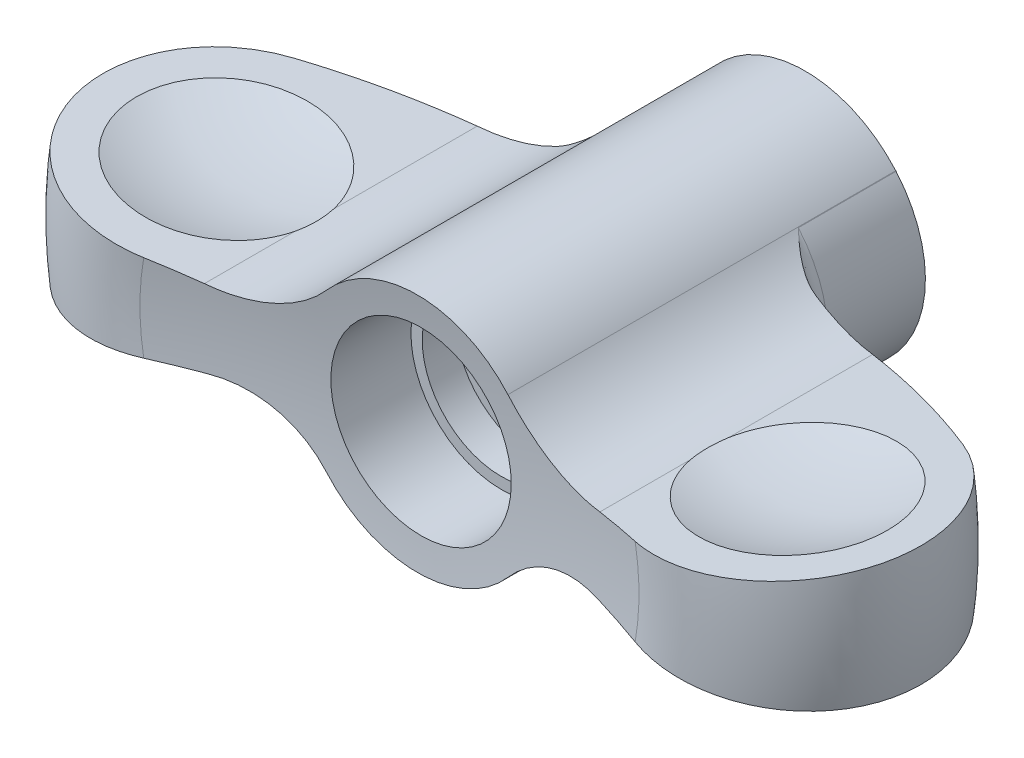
ISO-10303-21;
HEADER;
FILE_DESCRIPTION(('STEP AP214'),'2;1');
FILE_NAME('part.step','',(''),(''),'','','');
FILE_SCHEMA(('AUTOMOTIVE_DESIGN { 1 0 10303 214 1 1 1 1 }'));
ENDSEC;
DATA;
#1=APPLICATION_CONTEXT('core data for automotive mechanical design processes');
#2=APPLICATION_PROTOCOL_DEFINITION('international standard','automotive_design',2000,#1);
#3=PRODUCT_CONTEXT('',#1,'mechanical');
#4=PRODUCT('Part','Part','',(#3));
#5=PRODUCT_RELATED_PRODUCT_CATEGORY('part','',(#4));
#6=PRODUCT_DEFINITION_FORMATION('','',#4);
#7=PRODUCT_DEFINITION_CONTEXT('part definition',#1,'design');
#8=PRODUCT_DEFINITION('design','',#6,#7);
#9=PRODUCT_DEFINITION_SHAPE('','',#8);
#10=(LENGTH_UNIT() NAMED_UNIT(*) SI_UNIT(.MILLI.,.METRE.));
#11=(NAMED_UNIT(*) PLANE_ANGLE_UNIT() SI_UNIT($,.RADIAN.));
#12=(NAMED_UNIT(*) SI_UNIT($,.STERADIAN.) SOLID_ANGLE_UNIT());
#13=UNCERTAINTY_MEASURE_WITH_UNIT(LENGTH_MEASURE(1.E-05),#10,'distance_accuracy_value','');
#14=(GEOMETRIC_REPRESENTATION_CONTEXT(3) GLOBAL_UNCERTAINTY_ASSIGNED_CONTEXT((#13)) GLOBAL_UNIT_ASSIGNED_CONTEXT((#10,
#11,#12)) REPRESENTATION_CONTEXT('',''));
#15=CARTESIAN_POINT('',(0.,0.,0.));
#16=DIRECTION('',(0.,0.,1.));
#17=DIRECTION('',(1.,0.,0.));
#18=AXIS2_PLACEMENT_3D('',#15,#16,#17);
#19=CARTESIAN_POINT('',(0.,0.,6.5));
#20=DIRECTION('',(0.,0.,1.));
#21=DIRECTION('',(0.,-1.,0.));
#22=AXIS2_PLACEMENT_3D('',#19,#20,#21);
#23=TOROIDAL_SURFACE('',#22,9.4,1.40000000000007);
#24=DIRECTION('',(0.,0.,1.));
#25=VECTOR('',#24,1.);
#26=CARTESIAN_POINT('',(6.03890778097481,-5.2470556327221,-7.0380739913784));
#27=LINE('',#26,#25);
#28=CARTESIAN_POINT('',(6.03890778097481,-5.2470556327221,6.5));
#29=VERTEX_POINT('',#28);
#30=CARTESIAN_POINT('',(6.03890778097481,-5.2470556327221,6.50212008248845));
#31=VERTEX_POINT('',#30);
#32=EDGE_CURVE('E180',#29,#31,#27,.T.);
#33=ORIENTED_EDGE('',*,*,#32,.F.);
#34=CARTESIAN_POINT('',(0.,0.,6.5));
#35=DIRECTION('',(0.,0.,1.));
#36=DIRECTION('',(0.,-1.,0.));
#37=AXIS2_PLACEMENT_3D('',#34,#35,#36);
#38=CIRCLE('',#37,8.);
#39=CARTESIAN_POINT('',(6.0470062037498,5.23772049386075,6.5));
#40=VERTEX_POINT('',#39);
#41=EDGE_CURVE('E402',#29,#40,#38,.T.);
#42=ORIENTED_EDGE('',*,*,#41,.T.);
#43=CARTESIAN_POINT('',(8.59898254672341,3.29412567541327,7.8868206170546));
#44=CARTESIAN_POINT('',(8.51141815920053,3.33631021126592,7.87757295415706));
#45=CARTESIAN_POINT('',(8.42512324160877,3.37986689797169,7.86383925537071));
#46=CARTESIAN_POINT('',(8.25552733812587,3.46930142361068,7.82879311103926));
#47=CARTESIAN_POINT('',(8.17222071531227,3.51517445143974,7.80749586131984));
#48=CARTESIAN_POINT('',(8.00928400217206,3.60865711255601,7.75884124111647));
#49=CARTESIAN_POINT('',(7.92963203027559,3.65625212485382,7.73152791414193));
#50=CARTESIAN_POINT('',(7.77338079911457,3.75327693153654,7.67180748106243));
#51=CARTESIAN_POINT('',(7.69678296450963,3.80270756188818,7.63939803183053));
#52=CARTESIAN_POINT('',(7.51724415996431,3.9228836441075,7.55691032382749));
#53=CARTESIAN_POINT('',(7.41571994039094,3.99440279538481,7.50487985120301));
#54=CARTESIAN_POINT('',(7.21816387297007,4.14040328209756,7.39471306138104));
#55=CARTESIAN_POINT('',(7.12213718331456,4.21488729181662,7.3365711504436));
#56=CARTESIAN_POINT('',(6.89909833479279,4.39600037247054,7.19247655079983));
#57=CARTESIAN_POINT('',(6.77446584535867,4.50392052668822,7.10446467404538));
#58=CARTESIAN_POINT('',(6.57485157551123,4.68763024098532,6.9540735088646));
#59=CARTESIAN_POINT('',(6.49736321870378,4.7619072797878,6.89312126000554));
#60=CARTESIAN_POINT('',(6.37296054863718,4.88601102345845,6.79178977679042));
#61=CARTESIAN_POINT('',(6.32499252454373,4.93511681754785,6.75182074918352));
#62=CARTESIAN_POINT('',(6.24779625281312,5.01619850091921,6.68620361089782));
#63=CARTESIAN_POINT('',(6.21813895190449,5.04786120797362,6.66067187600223));
#64=CARTESIAN_POINT('',(6.17033482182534,5.09973563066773,6.61900123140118));
#65=CARTESIAN_POINT('',(6.15201397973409,5.11982116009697,6.60290481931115));
#66=CARTESIAN_POINT('',(6.12244478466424,5.15257170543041,6.57667362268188));
#67=CARTESIAN_POINT('',(6.11112210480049,5.16519318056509,6.56656814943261));
#68=CARTESIAN_POINT('',(6.09283224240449,5.18571154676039,6.55006512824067));
#69=CARTESIAN_POINT('',(6.08582724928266,5.19360153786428,6.54370123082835));
#70=CARTESIAN_POINT('',(6.07451533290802,5.2063931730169,6.53324372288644));
#71=CARTESIAN_POINT('',(6.07018138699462,5.21130628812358,6.52919336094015));
#72=CARTESIAN_POINT('',(6.06319526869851,5.21924541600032,6.52245610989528));
#73=CARTESIAN_POINT('',(6.06051754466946,5.22229316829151,6.51982285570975));
#74=CARTESIAN_POINT('',(6.05622209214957,5.22718951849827,6.51535418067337));
#75=CARTESIAN_POINT('',(6.05457550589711,5.22906827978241,6.51357999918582));
#76=CARTESIAN_POINT('',(6.05195439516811,5.23206168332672,6.51048008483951));
#77=CARTESIAN_POINT('',(6.05094876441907,5.23321085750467,6.50921868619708));
#78=CARTESIAN_POINT('',(6.04953567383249,5.23482648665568,6.50715333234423));
#79=CARTESIAN_POINT('',(6.04907752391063,5.2353504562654,6.50643002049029));
#80=CARTESIAN_POINT('',(6.04823578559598,5.2363133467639,6.50488896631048));
#81=CARTESIAN_POINT('',(6.04785159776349,5.2367529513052,6.50407207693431));
#82=CARTESIAN_POINT('',(6.04743690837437,5.23722752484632,6.50283591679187));
#83=CARTESIAN_POINT('',(6.04733310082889,5.23734633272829,6.50247536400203));
#84=CARTESIAN_POINT('',(6.04716429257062,5.23753954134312,6.50173449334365));
#85=CARTESIAN_POINT('',(6.04709913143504,5.23761412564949,6.50135426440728));
#86=CARTESIAN_POINT('',(6.04703741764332,5.23768476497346,6.50077580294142));
#87=CARTESIAN_POINT('',(6.04702284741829,5.23770144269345,6.50058184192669));
#88=CARTESIAN_POINT('',(6.04700611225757,5.23772059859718,6.50019185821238));
#89=CARTESIAN_POINT('',(6.04700400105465,5.23772301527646,6.49999583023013));
#90=CARTESIAN_POINT('',(6.0470084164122,5.23771796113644,6.4997999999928));
#91=B_SPLINE_CURVE_WITH_KNOTS('',3,(#43,#44,#45,#46,#47,#48,#49,#50,#51,#52,#53,#54,#55,#56,#57,
#58,#59,#60,#61,#62,#63,#64,#65,#66,#67,#68,#69,#70,#71,#72,#73,#74,#75,#76,#77,#78,#79,#80,#81,
#82,#83,#84,#85,#86,#87,#88,#89,#90),.UNSPECIFIED.,.F.,.F.,(4,2,2,2,2,2,2,2,2,2,2,2,2,2,2,2,2,2,
2,2,2,2,2,4),(0.,0.292609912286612,0.58463524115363,0.874589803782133,1.16467807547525,
1.56824756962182,1.97218971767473,2.53235699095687,2.9025934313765,3.14087410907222,
3.29188442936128,3.38666478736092,3.44588137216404,3.48284532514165,3.50595247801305,
3.52045898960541,3.52964962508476,3.53557823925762,3.53858720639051,3.54157065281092,
3.54274772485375,3.54391987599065,3.54450469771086,3.54509203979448),.UNSPECIFIED.);
#92=CARTESIAN_POINT('',(8.59708881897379,3.29503849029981,7.8866206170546));
#93=VERTEX_POINT('',#92);
#94=EDGE_CURVE('E347',#93,#40,#91,.T.);
#95=ORIENTED_EDGE('',*,*,#94,.F.);
#96=CARTESIAN_POINT('',(0.,0.,7.8866206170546));
#97=DIRECTION('',(0.,0.,1.));
#98=DIRECTION('',(0.,-1.,0.));
#99=AXIS2_PLACEMENT_3D('',#96,#97,#98);
#100=CIRCLE('',#99,9.20691125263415);
#101=CARTESIAN_POINT('',(8.59734587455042,-3.29436772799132,7.8866206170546));
#102=VERTEX_POINT('',#101);
#103=EDGE_CURVE('E398',#102,#93,#100,.T.);
#104=ORIENTED_EDGE('',*,*,#103,.F.);
#105=CARTESIAN_POINT('',(9.24838774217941,-3.01522896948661,7.8611549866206));
#106=CARTESIAN_POINT('',(9.19367387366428,-3.03586597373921,7.87212843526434));
#107=CARTESIAN_POINT('',(9.13880326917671,-3.05725699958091,7.88061358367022));
#108=CARTESIAN_POINT('',(9.02918340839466,-3.10140121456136,7.89300588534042));
#109=CARTESIAN_POINT('',(8.97443409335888,-3.12415231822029,7.8969198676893));
#110=CARTESIAN_POINT('',(8.81189994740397,-3.19383993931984,7.90240025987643));
#111=CARTESIAN_POINT('',(8.70468460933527,-3.24264189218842,7.8979138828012));
#112=CARTESIAN_POINT('',(8.51244986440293,-3.33527790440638,7.87768998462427));
#113=CARTESIAN_POINT('',(8.42685948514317,-3.37846333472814,7.86408345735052));
#114=CARTESIAN_POINT('',(8.25844994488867,-3.46721413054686,7.82939829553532));
#115=CARTESIAN_POINT('',(8.1756320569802,-3.51278056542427,7.80831627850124));
#116=CARTESIAN_POINT('',(7.93073591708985,-3.65314361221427,7.73552099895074));
#117=CARTESIAN_POINT('',(7.77324575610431,-3.75110326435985,7.67439750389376));
#118=CARTESIAN_POINT('',(7.51464053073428,-3.92422259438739,7.55555975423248));
#119=CARTESIAN_POINT('',(7.41040744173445,-3.99776965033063,7.50198430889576));
#120=CARTESIAN_POINT('',(7.20775000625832,-4.14796966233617,7.38844495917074));
#121=CARTESIAN_POINT('',(7.10932762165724,-4.2246236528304,7.32847891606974));
#122=CARTESIAN_POINT('',(6.91810375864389,-4.3807228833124,7.20404785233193));
#123=CARTESIAN_POINT('',(6.82529242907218,-4.46016282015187,7.13959117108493));
#124=CARTESIAN_POINT('',(6.64465512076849,-4.62196874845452,7.0075093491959));
#125=CARTESIAN_POINT('',(6.55682825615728,-4.70433421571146,6.93988477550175));
#126=CARTESIAN_POINT('',(6.43396887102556,-4.82482237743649,6.84137296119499));
#127=CARTESIAN_POINT('',(6.3970838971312,-4.86171240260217,6.81126516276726));
#128=CARTESIAN_POINT('',(6.32415661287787,-4.93608562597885,6.75076275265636));
#129=CARTESIAN_POINT('',(6.28811428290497,-4.97356881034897,6.72036814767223));
#130=CARTESIAN_POINT('',(6.23466025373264,-5.03025441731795,6.67467473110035));
#131=CARTESIAN_POINT('',(6.21694916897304,-5.04922052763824,6.65943137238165));
#132=CARTESIAN_POINT('',(6.18174487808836,-5.08728721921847,6.62885737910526));
#133=CARTESIAN_POINT('',(6.16425168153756,-5.10638780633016,6.61352674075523));
#134=CARTESIAN_POINT('',(6.12939253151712,-5.14482758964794,6.58303704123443));
#135=CARTESIAN_POINT('',(6.11202655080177,-5.16416673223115,6.56787794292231));
#136=CARTESIAN_POINT('',(6.07777325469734,-5.20267654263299,6.53681590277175));
#137=CARTESIAN_POINT('',(6.06088576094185,-5.22184727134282,6.52091324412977));
#138=CARTESIAN_POINT('',(6.04125231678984,-5.24436288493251,6.50407143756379));
#139=CARTESIAN_POINT('',(6.03883130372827,-5.24714315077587,6.50202251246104));
#140=CARTESIAN_POINT('',(6.036402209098,-5.24993655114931,6.5));
#141=B_SPLINE_CURVE_WITH_KNOTS('',3,(#105,#106,#107,#108,#109,#110,#111,#112,#113,#114,#115,
#116,#117,#118,#119,#120,#121,#122,#123,#124,#125,#126,#127,#128,#129,#130,#131,#132,#133,#134,
#135,#136,#137,#138,#139,#140),.UNSPECIFIED.,.F.,.F.,(4,2,2,2,2,2,2,2,2,2,2,2,2,2,2,2,2,4),(0.,
0.178348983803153,0.356431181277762,0.708912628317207,0.999032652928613,1.28928411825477,
1.87321137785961,2.28803676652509,2.70300142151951,3.1172150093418,3.53135474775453,
3.71204340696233,3.89272785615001,3.98301462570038,4.07330534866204,4.16357613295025,
4.25381281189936,4.26646608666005),.UNSPECIFIED.);
#142=EDGE_CURVE('E331',#31,#102,#141,.F.);
#143=ORIENTED_EDGE('',*,*,#142,.F.);
#144=EDGE_LOOP('',(#33,#42,#95,#104,#143));
#145=FACE_BOUND('',#144,.T.);
#146=ADVANCED_FACE('F14',(#145),#23,.F.);
#147=CARTESIAN_POINT('',(0.,0.,84.9218512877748));
#148=DIRECTION('',(0.,0.,1.));
#149=DIRECTION('',(0.,-1.,0.));
#150=AXIS2_PLACEMENT_3D('',#147,#148,#149);
#151=DEGENERATE_TOROIDAL_SURFACE('',#150,0.267106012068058,59.7,.F.);
#152=CARTESIAN_POINT('',(0.,0.,25.5517124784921));
#153=DIRECTION('',(0.,0.,1.));
#154=DIRECTION('',(0.,-1.,0.));
#155=AXIS2_PLACEMENT_3D('',#152,#153,#154);
#156=CIRCLE('',#155,6.);
#157=CARTESIAN_POINT('',(0.,-6.,25.5517124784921));
#158=VERTEX_POINT('',#157);
#159=EDGE_CURVE('E226',#158,#158,#156,.T.);
#160=ORIENTED_EDGE('',*,*,#159,.F.);
#161=EDGE_LOOP('',(#160));
#162=FACE_BOUND('',#161,.T.);
#163=CARTESIAN_POINT('',(12.9966083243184,-2.55402529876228,26.7711157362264));
#164=CARTESIAN_POINT('',(12.7754529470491,-2.52825709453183,26.719533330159));
#165=CARTESIAN_POINT('',(12.5528725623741,-2.5117272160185,26.6693936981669));
#166=CARTESIAN_POINT('',(12.1063783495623,-2.49733345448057,26.5723334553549));
#167=CARTESIAN_POINT('',(11.8824643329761,-2.49947227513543,26.5254133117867));
#168=CARTESIAN_POINT('',(11.4348095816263,-2.52261669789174,26.4351255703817));
#169=CARTESIAN_POINT('',(11.2110689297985,-2.54362860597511,26.3917591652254));
#170=CARTESIAN_POINT('',(10.7654590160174,-2.60455176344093,26.3089232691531));
#171=CARTESIAN_POINT('',(10.5435896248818,-2.64446169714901,26.2694535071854));
#172=CARTESIAN_POINT('',(10.1029278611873,-2.7431637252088,26.1946447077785));
#173=CARTESIAN_POINT('',(9.88414203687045,-2.80199107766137,26.1593135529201));
#174=CARTESIAN_POINT('',(9.45174044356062,-2.93823754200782,26.0931563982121));
#175=CARTESIAN_POINT('',(9.23812452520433,-3.01565611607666,26.0623302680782));
#176=CARTESIAN_POINT('',(8.81794496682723,-3.18856082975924,26.0054747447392));
#177=CARTESIAN_POINT('',(8.61137399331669,-3.28402745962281,25.979440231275));
#178=CARTESIAN_POINT('',(8.20669244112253,-3.49247951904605,25.9323600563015));
#179=CARTESIAN_POINT('',(8.00858079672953,-3.60546273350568,25.9113137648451));
#180=CARTESIAN_POINT('',(7.65039872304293,-3.83057518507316,25.8770779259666));
#181=CARTESIAN_POINT('',(7.48897596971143,-3.94045548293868,25.8631917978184));
#182=CARTESIAN_POINT('',(7.1744293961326,-4.17187167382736,25.8393036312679));
#183=CARTESIAN_POINT('',(7.02130457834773,-4.29340616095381,25.8293011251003));
#184=CARTESIAN_POINT('',(6.72399395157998,-4.54769946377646,25.8132388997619));
#185=CARTESIAN_POINT('',(6.57982418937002,-4.68047747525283,25.8071860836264));
#186=CARTESIAN_POINT('',(6.30152732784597,-4.95633540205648,25.7990887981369));
#187=CARTESIAN_POINT('',(6.16740216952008,-5.09941729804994,25.7970451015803));
#188=CARTESIAN_POINT('',(6.03873367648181,-5.2472556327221,25.7970260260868));
#189=B_SPLINE_CURVE_WITH_KNOTS('',3,(#163,#164,#165,#166,#167,#168,#169,#170,#171,#172,#173,
#174,#175,#176,#177,#178,#179,#180,#181,#182,#183,#184,#185,#186,#187,#188),.UNSPECIFIED.,.F.,
.F.,(4,2,2,2,2,2,2,2,2,2,2,2,4),(0.,0.685469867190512,1.37103900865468,2.05683730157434,
2.74258785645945,3.42962398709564,4.1166402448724,4.80291804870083,5.48910913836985,
6.07586072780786,6.66254162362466,7.25024515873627,7.83806196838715),.UNSPECIFIED.);
#190=CARTESIAN_POINT('',(12.9964083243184,-2.55400201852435,26.7710690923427));
#191=VERTEX_POINT('',#190);
#192=CARTESIAN_POINT('',(6.03890778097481,-5.2470556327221,25.7970260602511));
#193=VERTEX_POINT('',#192);
#194=EDGE_CURVE('E337',#191,#193,#189,.T.);
#195=ORIENTED_EDGE('',*,*,#194,.F.);
#196=CARTESIAN_POINT('',(12.9962083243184,-2.55398166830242,26.7710225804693));
#197=CARTESIAN_POINT('',(13.5586098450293,-2.61120664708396,26.9018172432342));
#198=CARTESIAN_POINT('',(14.1188767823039,-2.66821442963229,27.0407918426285));
#199=CARTESIAN_POINT('',(15.2351414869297,-2.78179560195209,27.3351009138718));
#200=CARTESIAN_POINT('',(15.7911392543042,-2.83836899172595,27.4904353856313));
#201=CARTESIAN_POINT('',(16.3450024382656,-2.89472518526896,27.6539497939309));
#202=B_SPLINE_CURVE_WITH_KNOTS('',3,(#196,#197,#198,#199,#200,#201),.UNSPECIFIED.,.F.,.F.,(4,2,
4),(0.,1.74016258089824,3.48032515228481),.UNSPECIFIED.);
#203=CARTESIAN_POINT('',(16.3443249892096,-2.89465625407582,27.6537497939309));
#204=VERTEX_POINT('',#203);
#205=EDGE_CURVE('E277',#191,#204,#202,.T.);
#206=ORIENTED_EDGE('',*,*,#205,.T.);
#207=CARTESIAN_POINT('',(0.,0.,27.6537497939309));
#208=DIRECTION('',(0.,0.,1.));
#209=DIRECTION('',(0.,-1.,0.));
#210=AXIS2_PLACEMENT_3D('',#207,#208,#209);
#211=CIRCLE('',#210,16.5986744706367);
#212=CARTESIAN_POINT('',(16.3437132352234,2.89810832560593,27.6537497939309));
#213=VERTEX_POINT('',#212);
#214=EDGE_CURVE('E390',#204,#213,#211,.T.);
#215=ORIENTED_EDGE('',*,*,#214,.T.);
#216=CARTESIAN_POINT('',(13.1526156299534,2.57444288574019,26.8078255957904));
#217=CARTESIAN_POINT('',(13.6884788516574,2.6287942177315,26.9339805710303));
#218=CARTESIAN_POINT('',(14.2223917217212,2.68294773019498,27.0675684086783));
#219=CARTESIAN_POINT('',(15.2863167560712,2.79085911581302,27.3496098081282));
#220=CARTESIAN_POINT('',(15.8163289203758,2.84461698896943,27.4980633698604));
#221=CARTESIAN_POINT('',(16.3443907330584,2.89817704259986,27.6539497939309));
#222=B_SPLINE_CURVE_WITH_KNOTS('',3,(#216,#217,#218,#219,#220,#221),.UNSPECIFIED.,.F.,.F.,(4,2,
4),(0.,1.65908751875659,3.31817502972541),.UNSPECIFIED.);
#223=CARTESIAN_POINT('',(13.1528156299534,2.57446317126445,26.8078726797));
#224=VERTEX_POINT('',#223);
#225=EDGE_CURVE('E296',#224,#213,#222,.T.);
#226=ORIENTED_EDGE('',*,*,#225,.F.);
#227=CARTESIAN_POINT('',(6.024532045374,5.26355694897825,25.7970262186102));
#228=CARTESIAN_POINT('',(6.16690476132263,5.09913304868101,25.7968869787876));
#229=CARTESIAN_POINT('',(6.31601972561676,4.94055485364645,25.7992439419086));
#230=CARTESIAN_POINT('',(6.62655584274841,4.63614521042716,25.8088925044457));
#231=CARTESIAN_POINT('',(6.7879754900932,4.49031220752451,25.8161835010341));
#232=CARTESIAN_POINT('',(7.12145474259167,4.21284299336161,25.8356118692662));
#233=CARTESIAN_POINT('',(7.29347942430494,4.08116373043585,25.847733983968));
#234=CARTESIAN_POINT('',(7.64736462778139,3.83234945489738,25.8767149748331));
#235=CARTESIAN_POINT('',(7.82922517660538,3.71521448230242,25.893573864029));
#236=CARTESIAN_POINT('',(8.20178776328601,3.49604471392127,25.9319185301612));
#237=CARTESIAN_POINT('',(8.39250457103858,3.39403642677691,25.9534122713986));
#238=CARTESIAN_POINT('',(8.78119845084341,3.20593098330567,26.0008427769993));
#239=CARTESIAN_POINT('',(8.97917867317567,3.11984083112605,26.0267814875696));
#240=CARTESIAN_POINT('',(9.38110362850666,2.96402714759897,26.0829169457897));
#241=CARTESIAN_POINT('',(9.58505370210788,2.89431880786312,26.1131176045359));
#242=CARTESIAN_POINT('',(9.99723627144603,2.77173272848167,26.1775161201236));
#243=CARTESIAN_POINT('',(10.2054670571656,2.71884840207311,26.2117124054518));
#244=CARTESIAN_POINT('',(10.641032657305,2.62666034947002,26.286643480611));
#245=CARTESIAN_POINT('',(10.8686042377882,2.58871528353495,26.3276789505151));
#246=CARTESIAN_POINT('',(11.325443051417,2.5326356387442,26.4137825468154));
#247=CARTESIAN_POINT('',(11.5547105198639,2.51450386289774,26.4588512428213));
#248=CARTESIAN_POINT('',(12.0133084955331,2.49800092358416,26.552689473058));
#249=CARTESIAN_POINT('',(12.242638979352,2.49963935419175,26.6014607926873));
#250=CARTESIAN_POINT('',(12.6995448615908,2.5224660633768,26.7023049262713));
#251=CARTESIAN_POINT('',(12.927120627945,2.54365012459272,26.7543770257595));
#252=CARTESIAN_POINT('',(13.1530156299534,2.5744904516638,26.8079200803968));
#253=B_SPLINE_CURVE_WITH_KNOTS('',3,(#227,#228,#229,#230,#231,#232,#233,#234,#235,#236,#237,
#238,#239,#240,#241,#242,#243,#244,#245,#246,#247,#248,#249,#250,#251,#252),.UNSPECIFIED.,.F.,
.F.,(4,2,2,2,2,2,2,2,2,2,2,2,4),(0.,0.65228767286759,1.3044956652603,1.95466006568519,
2.60482625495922,3.25611868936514,3.90769702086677,4.55987722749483,5.21180178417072,
5.91390661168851,6.61611075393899,7.31865567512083,8.02104904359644),.UNSPECIFIED.);
#254=CARTESIAN_POINT('',(6.02470527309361,5.26335694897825,25.7970260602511));
#255=VERTEX_POINT('',#254);
#256=EDGE_CURVE('E375',#255,#224,#253,.T.);
#257=ORIENTED_EDGE('',*,*,#256,.F.);
#258=CARTESIAN_POINT('',(0.,0.,25.7970260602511));
#259=DIRECTION('',(0.,0.,1.));
#260=DIRECTION('',(0.,-1.,0.));
#261=AXIS2_PLACEMENT_3D('',#258,#259,#260);
#262=CIRCLE('',#261,8.);
#263=CARTESIAN_POINT('',(-6.0247052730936,5.26335694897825,25.7970260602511));
#264=VERTEX_POINT('',#263);
#265=EDGE_CURVE('E382',#255,#264,#262,.T.);
#266=ORIENTED_EDGE('',*,*,#265,.T.);
#267=CARTESIAN_POINT('',(-6.02453204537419,5.26355694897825,25.7970262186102));
#268=CARTESIAN_POINT('',(-6.16690476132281,5.099133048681,25.7968869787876));
#269=CARTESIAN_POINT('',(-6.31601972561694,4.94055485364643,25.7992439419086));
#270=CARTESIAN_POINT('',(-6.62655584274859,4.63614521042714,25.8088925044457));
#271=CARTESIAN_POINT('',(-6.78797549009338,4.4903122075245,25.8161835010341));
#272=CARTESIAN_POINT('',(-7.12145474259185,4.21284299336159,25.8356118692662));
#273=CARTESIAN_POINT('',(-7.29347942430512,4.08116373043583,25.847733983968));
#274=CARTESIAN_POINT('',(-7.64736462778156,3.83234945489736,25.8767149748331));
#275=CARTESIAN_POINT('',(-7.82922517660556,3.71521448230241,25.893573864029));
#276=CARTESIAN_POINT('',(-8.20178776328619,3.49604471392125,25.9319185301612));
#277=CARTESIAN_POINT('',(-8.39250457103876,3.39403642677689,25.9534122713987));
#278=CARTESIAN_POINT('',(-8.78119845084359,3.20593098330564,26.0008427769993));
#279=CARTESIAN_POINT('',(-8.97917867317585,3.11984083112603,26.0267814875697));
#280=CARTESIAN_POINT('',(-9.38110362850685,2.96402714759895,26.0829169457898));
#281=CARTESIAN_POINT('',(-9.58505370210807,2.89431880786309,26.1131176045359));
#282=CARTESIAN_POINT('',(-9.99723627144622,2.77173272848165,26.1775161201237));
#283=CARTESIAN_POINT('',(-10.2054670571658,2.7188484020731,26.2117124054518));
#284=CARTESIAN_POINT('',(-10.6410326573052,2.62666034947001,26.286643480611));
#285=CARTESIAN_POINT('',(-10.8686042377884,2.58871528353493,26.3276789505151));
#286=CARTESIAN_POINT('',(-11.3254430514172,2.53263563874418,26.4137825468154));
#287=CARTESIAN_POINT('',(-11.5547105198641,2.51450386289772,26.4588512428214));
#288=CARTESIAN_POINT('',(-12.0133084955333,2.49800092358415,26.5526894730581));
#289=CARTESIAN_POINT('',(-12.2426389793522,2.49963935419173,26.6014607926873));
#290=CARTESIAN_POINT('',(-12.699544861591,2.52246606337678,26.7023049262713));
#291=CARTESIAN_POINT('',(-12.9271206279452,2.5436501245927,26.7543770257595));
#292=CARTESIAN_POINT('',(-13.1530156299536,2.57449045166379,26.8079200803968));
#293=B_SPLINE_CURVE_WITH_KNOTS('',3,(#267,#268,#269,#270,#271,#272,#273,#274,#275,#276,#277,
#278,#279,#280,#281,#282,#283,#284,#285,#286,#287,#288,#289,#290,#291,#292),.UNSPECIFIED.,.F.,
.F.,(4,2,2,2,2,2,2,2,2,2,2,2,4),(0.,0.652287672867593,1.3044956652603,1.95466006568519,
2.60482625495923,3.25611868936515,3.90769702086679,4.55987722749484,5.21180178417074,
5.91390661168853,6.61611075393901,7.31865567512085,8.02104904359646),.UNSPECIFIED.);
#294=CARTESIAN_POINT('',(-13.1528156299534,2.57446317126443,26.8078726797));
#295=VERTEX_POINT('',#294);
#296=EDGE_CURVE('E497',#264,#295,#293,.T.);
#297=ORIENTED_EDGE('',*,*,#296,.T.);
#298=CARTESIAN_POINT('',(-13.1526156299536,2.57444288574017,26.8078255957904));
#299=CARTESIAN_POINT('',(-13.6884788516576,2.62879421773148,26.9339805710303));
#300=CARTESIAN_POINT('',(-14.2223917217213,2.68294773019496,27.0675684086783));
#301=CARTESIAN_POINT('',(-15.2863167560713,2.79085911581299,27.3496098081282));
#302=CARTESIAN_POINT('',(-15.8163289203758,2.8446169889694,27.4980633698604));
#303=CARTESIAN_POINT('',(-16.3443907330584,2.89817704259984,27.6539497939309));
#304=B_SPLINE_CURVE_WITH_KNOTS('',3,(#298,#299,#300,#301,#302,#303),.UNSPECIFIED.,.F.,.F.,(4,2,
4),(0.,1.6590875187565,3.31817502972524),.UNSPECIFIED.);
#305=CARTESIAN_POINT('',(-16.3437132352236,2.89810832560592,27.6537497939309));
#306=VERTEX_POINT('',#305);
#307=EDGE_CURVE('E196',#295,#306,#304,.T.);
#308=ORIENTED_EDGE('',*,*,#307,.T.);
#309=CARTESIAN_POINT('',(-16.3443249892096,-2.89465625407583,27.6537497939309));
#310=VERTEX_POINT('',#309);
#311=EDGE_CURVE('E389',#306,#310,#211,.T.);
#312=ORIENTED_EDGE('',*,*,#311,.T.);
#313=CARTESIAN_POINT('',(-12.9962083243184,-2.55398166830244,26.7710225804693));
#314=CARTESIAN_POINT('',(-13.5586098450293,-2.61120664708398,26.9018172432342));
#315=CARTESIAN_POINT('',(-14.1188767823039,-2.6682144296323,27.0407918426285));
#316=CARTESIAN_POINT('',(-15.2351414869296,-2.7817956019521,27.3351009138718));
#317=CARTESIAN_POINT('',(-15.7911392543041,-2.83836899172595,27.4904353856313));
#318=CARTESIAN_POINT('',(-16.3450024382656,-2.89472518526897,27.6539497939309));
#319=B_SPLINE_CURVE_WITH_KNOTS('',3,(#313,#314,#315,#316,#317,#318),.UNSPECIFIED.,.F.,.F.,(4,2,
4),(0.,1.74016258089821,3.48032515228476),.UNSPECIFIED.);
#320=CARTESIAN_POINT('',(-12.9964083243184,-2.55400201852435,26.77106909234));
#321=VERTEX_POINT('',#320);
#322=EDGE_CURVE('E278',#321,#310,#319,.T.);
#323=ORIENTED_EDGE('',*,*,#322,.F.);
#324=CARTESIAN_POINT('',(-12.9966083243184,-2.55402529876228,26.7711157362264));
#325=CARTESIAN_POINT('',(-12.7754529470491,-2.52825709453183,26.719533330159));
#326=CARTESIAN_POINT('',(-12.5528725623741,-2.5117272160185,26.6693936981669));
#327=CARTESIAN_POINT('',(-12.1063783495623,-2.49733345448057,26.5723334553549));
#328=CARTESIAN_POINT('',(-11.8824643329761,-2.49947227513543,26.5254133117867));
#329=CARTESIAN_POINT('',(-11.4348095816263,-2.52261669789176,26.4351255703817));
#330=CARTESIAN_POINT('',(-11.2110689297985,-2.54362860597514,26.3917591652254));
#331=CARTESIAN_POINT('',(-10.7654590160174,-2.60455176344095,26.3089232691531));
#332=CARTESIAN_POINT('',(-10.5435896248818,-2.64446169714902,26.2694535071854));
#333=CARTESIAN_POINT('',(-10.1029278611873,-2.74316372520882,26.1946447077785));
#334=CARTESIAN_POINT('',(-9.88414203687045,-2.80199107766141,26.1593135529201));
#335=CARTESIAN_POINT('',(-9.45174044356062,-2.93823754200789,26.0931563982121));
#336=CARTESIAN_POINT('',(-9.23812452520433,-3.01565611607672,26.0623302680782));
#337=CARTESIAN_POINT('',(-8.81794496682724,-3.18856082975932,26.0054747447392));
#338=CARTESIAN_POINT('',(-8.61137399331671,-3.28402745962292,25.979440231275));
#339=CARTESIAN_POINT('',(-8.20669244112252,-3.49247951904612,25.9323600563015));
#340=CARTESIAN_POINT('',(-8.0085807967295,-3.6054627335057,25.9113137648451));
#341=CARTESIAN_POINT('',(-7.65039872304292,-3.83057518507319,25.8770779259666));
#342=CARTESIAN_POINT('',(-7.48897596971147,-3.94045548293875,25.8631917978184));
#343=CARTESIAN_POINT('',(-7.1744293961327,-4.17187167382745,25.839303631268));
#344=CARTESIAN_POINT('',(-7.02130457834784,-4.29340616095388,25.8293011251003));
#345=CARTESIAN_POINT('',(-6.72399395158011,-4.5476994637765,25.8132388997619));
#346=CARTESIAN_POINT('',(-6.57982418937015,-4.68047747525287,25.8071860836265));
#347=CARTESIAN_POINT('',(-6.30152732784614,-4.9563354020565,25.799088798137));
#348=CARTESIAN_POINT('',(-6.16740216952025,-5.09941729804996,25.7970451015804));
#349=CARTESIAN_POINT('',(-6.03873367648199,-5.24725563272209,25.7970260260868));
#350=B_SPLINE_CURVE_WITH_KNOTS('',3,(#324,#325,#326,#327,#328,#329,#330,#331,#332,#333,#334,
#335,#336,#337,#338,#339,#340,#341,#342,#343,#344,#345,#346,#347,#348,#349),.UNSPECIFIED.,.F.,
.F.,(4,2,2,2,2,2,2,2,2,2,2,2,4),(0.,0.685469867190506,1.37103900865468,2.05683730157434,
2.74258785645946,3.42962398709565,4.11664024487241,4.80291804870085,5.48910913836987,
6.07586072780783,6.66254162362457,7.25024515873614,7.83806196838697),.UNSPECIFIED.);
#351=CARTESIAN_POINT('',(-6.03890778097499,-5.2470556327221,25.7970260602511));
#352=VERTEX_POINT('',#351);
#353=EDGE_CURVE('E338',#321,#352,#350,.T.);
#354=ORIENTED_EDGE('',*,*,#353,.T.);
#355=CARTESIAN_POINT('',(0.,0.,25.7970260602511));
#356=DIRECTION('',(0.,0.,1.));
#357=DIRECTION('',(0.,-1.,0.));
#358=AXIS2_PLACEMENT_3D('',#355,#356,#357);
#359=CIRCLE('',#358,8.);
#360=EDGE_CURVE('E386',#352,#193,#359,.T.);
#361=ORIENTED_EDGE('',*,*,#360,.T.);
#362=EDGE_LOOP('',(#195,#206,#215,#226,#257,#266,#297,#308,#312,#323,#354,#361));
#363=FACE_BOUND('',#362,.T.);
#364=ADVANCED_FACE('F16',(#162,#363),#151,.T.);
#365=CARTESIAN_POINT('',(7.9999999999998,0.,0.));
#366=DIRECTION('',(0.,0.,-1.));
#367=DIRECTION('',(0.,1.,0.));
#368=AXIS2_PLACEMENT_3D('',#365,#366,#367);
#369=PLANE('',#368);
#370=CARTESIAN_POINT('',(0.,0.,0.));
#371=DIRECTION('',(0.,0.,1.));
#372=DIRECTION('',(0.,-1.,0.));
#373=AXIS2_PLACEMENT_3D('',#370,#371,#372);
#374=CIRCLE('',#373,3.);
#375=CARTESIAN_POINT('',(0.,-3.,0.));
#376=VERTEX_POINT('',#375);
#377=EDGE_CURVE('E409',#376,#376,#374,.T.);
#378=ORIENTED_EDGE('',*,*,#377,.T.);
#379=EDGE_LOOP('',(#378));
#380=FACE_BOUND('',#379,.T.);
#381=CARTESIAN_POINT('',(12.0717114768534,10.5010774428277,0.));
#382=DIRECTION('',(0.,0.,-1.));
#383=DIRECTION('',(0.,1.,0.));
#384=AXIS2_PLACEMENT_3D('',#381,#382,#383);
#385=CIRCLE('',#384,8.);
#386=CARTESIAN_POINT('',(6.0470062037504,5.23772049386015,0.));
#387=VERTEX_POINT('',#386);
#388=CARTESIAN_POINT('',(6.024705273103,5.26335694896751,0.));
#389=VERTEX_POINT('',#388);
#390=EDGE_CURVE('E383',#387,#389,#385,.T.);
#391=ORIENTED_EDGE('',*,*,#390,.F.);
#392=CARTESIAN_POINT('',(0.,0.,0.));
#393=DIRECTION('',(0.,0.,1.));
#394=DIRECTION('',(0.,-1.,0.));
#395=AXIS2_PLACEMENT_3D('',#392,#393,#394);
#396=CIRCLE('',#395,8.);
#397=CARTESIAN_POINT('',(-6.04700620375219,5.23772049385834,0.));
#398=VERTEX_POINT('',#397);
#399=EDGE_CURVE('E406',#398,#387,#396,.T.);
#400=ORIENTED_EDGE('',*,*,#399,.F.);
#401=CARTESIAN_POINT('',(-12.0717114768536,10.5010774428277,0.));
#402=DIRECTION('',(0.,0.,-1.));
#403=DIRECTION('',(0.,1.,0.));
#404=AXIS2_PLACEMENT_3D('',#401,#402,#403);
#405=CIRCLE('',#404,8.);
#406=CARTESIAN_POINT('',(-6.02470527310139,5.26335694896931,0.));
#407=VERTEX_POINT('',#406);
#408=EDGE_CURVE('E509',#398,#407,#405,.F.);
#409=ORIENTED_EDGE('',*,*,#408,.T.);
#410=EDGE_CURVE('E405',#389,#407,#396,.T.);
#411=ORIENTED_EDGE('',*,*,#410,.F.);
#412=EDGE_LOOP('',(#391,#400,#409,#411));
#413=FACE_BOUND('',#412,.T.);
#414=ADVANCED_FACE('F431',(#380,#413),#369,.T.);
#415=CARTESIAN_POINT('',(0.,0.,32.9619260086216));
#416=DIRECTION('',(0.,0.,1.));
#417=DIRECTION('',(0.,-1.,0.));
#418=AXIS2_PLACEMENT_3D('',#415,#416,#417);
#419=CYLINDRICAL_SURFACE('',#418,8.);
#420=DIRECTION('',(0.,0.,1.));
#421=VECTOR('',#420,1.);
#422=CARTESIAN_POINT('',(-6.0247052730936,5.26335694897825,-7.0380739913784));
#423=LINE('',#422,#421);
#424=EDGE_CURVE('E170',#407,#264,#423,.T.);
#425=ORIENTED_EDGE('',*,*,#424,.T.);
#426=ORIENTED_EDGE('',*,*,#265,.F.);
#427=DIRECTION('',(0.,0.,1.));
#428=VECTOR('',#427,1.);
#429=CARTESIAN_POINT('',(6.02470527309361,5.26335694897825,-7.0380739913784));
#430=LINE('',#429,#428);
#431=EDGE_CURVE('E520',#389,#255,#430,.T.);
#432=ORIENTED_EDGE('',*,*,#431,.F.);
#433=ORIENTED_EDGE('',*,*,#410,.T.);
#434=EDGE_LOOP('',(#425,#426,#432,#433));
#435=FACE_BOUND('',#434,.T.);
#436=ADVANCED_FACE('F316',(#435),#419,.T.);
#437=DIRECTION('',(0.,0.,1.));
#438=VECTOR('',#437,1.);
#439=CARTESIAN_POINT('',(-6.04700620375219,5.23772049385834,3.25));
#440=LINE('',#439,#438);
#441=CARTESIAN_POINT('',(-6.04700620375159,5.23772049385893,6.5));
#442=VERTEX_POINT('',#441);
#443=EDGE_CURVE('E309',#398,#442,#440,.T.);
#444=ORIENTED_EDGE('',*,*,#443,.F.);
#445=ORIENTED_EDGE('',*,*,#399,.T.);
#446=DIRECTION('',(0.,0.,1.));
#447=VECTOR('',#446,1.);
#448=CARTESIAN_POINT('',(6.0470062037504,5.23772049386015,3.25));
#449=LINE('',#448,#447);
#450=EDGE_CURVE('E354',#387,#40,#449,.T.);
#451=ORIENTED_EDGE('',*,*,#450,.T.);
#452=ORIENTED_EDGE('',*,*,#41,.F.);
#453=ORIENTED_EDGE('',*,*,#32,.T.);
#454=EDGE_CURVE('E177',#31,#193,#27,.T.);
#455=ORIENTED_EDGE('',*,*,#454,.T.);
#456=ORIENTED_EDGE('',*,*,#360,.F.);
#457=DIRECTION('',(0.,0.,1.));
#458=VECTOR('',#457,1.);
#459=CARTESIAN_POINT('',(-6.03890778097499,-5.2470556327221,-7.0380739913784));
#460=LINE('',#459,#458);
#461=CARTESIAN_POINT('',(-6.03890778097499,-5.2470556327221,6.50212008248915));
#462=VERTEX_POINT('',#461);
#463=EDGE_CURVE('E168',#462,#352,#460,.T.);
#464=ORIENTED_EDGE('',*,*,#463,.F.);
#465=CARTESIAN_POINT('',(-6.03890778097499,-5.2470556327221,6.5));
#466=VERTEX_POINT('',#465);
#467=EDGE_CURVE('E176',#466,#462,#460,.T.);
#468=ORIENTED_EDGE('',*,*,#467,.F.);
#469=EDGE_CURVE('E401',#442,#466,#38,.T.);
#470=ORIENTED_EDGE('',*,*,#469,.F.);
#471=EDGE_LOOP('',(#444,#445,#451,#452,#453,#455,#456,#464,#468,#470));
#472=FACE_BOUND('',#471,.T.);
#473=ADVANCED_FACE('F440',(#472),#419,.T.);
#474=ORIENTED_EDGE('',*,*,#469,.T.);
#475=ORIENTED_EDGE('',*,*,#467,.T.);
#476=CARTESIAN_POINT('',(-9.24838774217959,-3.01522896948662,7.8611549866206));
#477=CARTESIAN_POINT('',(-9.19367387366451,-3.03586597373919,7.87212843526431));
#478=CARTESIAN_POINT('',(-9.13880326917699,-3.05725699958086,7.88061358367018));
#479=CARTESIAN_POINT('',(-9.02918340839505,-3.10140121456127,7.89300588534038));
#480=CARTESIAN_POINT('',(-8.97443409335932,-3.12415231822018,7.89691986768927));
#481=CARTESIAN_POINT('',(-8.8118999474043,-3.19383993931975,7.90240025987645));
#482=CARTESIAN_POINT('',(-8.70468460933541,-3.24264189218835,7.89791388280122));
#483=CARTESIAN_POINT('',(-8.51244986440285,-3.33527790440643,7.87768998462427));
#484=CARTESIAN_POINT('',(-8.42685948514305,-3.37846333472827,7.86408345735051));
#485=CARTESIAN_POINT('',(-8.25844994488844,-3.4672141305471,7.82939829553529));
#486=CARTESIAN_POINT('',(-8.1756320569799,-3.51278056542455,7.80831627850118));
#487=CARTESIAN_POINT('',(-7.93073591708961,-3.65314361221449,7.73552099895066));
#488=CARTESIAN_POINT('',(-7.77324575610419,-3.75110326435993,7.67439750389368));
#489=CARTESIAN_POINT('',(-7.51464053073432,-3.9242225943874,7.55555975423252));
#490=CARTESIAN_POINT('',(-7.41040744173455,-3.99776965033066,7.50198430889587));
#491=CARTESIAN_POINT('',(-7.2077500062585,-4.14796966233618,7.38844495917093));
#492=CARTESIAN_POINT('',(-7.10932762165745,-4.22462365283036,7.32847891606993));
#493=CARTESIAN_POINT('',(-6.91810375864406,-4.38072288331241,7.20404785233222));
#494=CARTESIAN_POINT('',(-6.82529242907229,-4.46016282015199,7.13959117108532));
#495=CARTESIAN_POINT('',(-6.64465512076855,-4.62196874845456,7.00750934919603));
#496=CARTESIAN_POINT('',(-6.55682825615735,-4.70433421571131,6.93988477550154));
#497=CARTESIAN_POINT('',(-6.43396887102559,-4.82482237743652,6.84137296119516));
#498=CARTESIAN_POINT('',(-6.39708389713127,-4.86171240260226,6.81126516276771));
#499=CARTESIAN_POINT('',(-6.32415661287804,-4.93608562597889,6.75076275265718));
#500=CARTESIAN_POINT('',(-6.28811428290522,-4.97356881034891,6.72036814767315));
#501=CARTESIAN_POINT('',(-6.2346602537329,-5.03025441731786,6.67467473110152));
#502=CARTESIAN_POINT('',(-6.21694916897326,-5.04922052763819,6.6594313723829));
#503=CARTESIAN_POINT('',(-6.18174487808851,-5.08728721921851,6.62885737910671));
#504=CARTESIAN_POINT('',(-6.16425168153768,-5.10638780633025,6.61352674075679));
#505=CARTESIAN_POINT('',(-6.129392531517,-5.14482758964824,6.5830370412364));
#506=CARTESIAN_POINT('',(-6.11202655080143,-5.1641667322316,6.56787794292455));
#507=CARTESIAN_POINT('',(-6.07777325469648,-5.2026765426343,6.53681590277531));
#508=CARTESIAN_POINT('',(-6.06088576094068,-5.22184727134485,6.52091324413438));
#509=CARTESIAN_POINT('',(-6.04125231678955,-5.24436288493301,6.5040714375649));
#510=CARTESIAN_POINT('',(-6.03883130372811,-5.24714315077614,6.50202251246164));
#511=CARTESIAN_POINT('',(-6.036402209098,-5.2499365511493,6.5));
#512=B_SPLINE_CURVE_WITH_KNOTS('',3,(#476,#477,#478,#479,#480,#481,#482,#483,#484,#485,#486,
#487,#488,#489,#490,#491,#492,#493,#494,#495,#496,#497,#498,#499,#500,#501,#502,#503,#504,#505,
#506,#507,#508,#509,#510,#511),.UNSPECIFIED.,.F.,.F.,(4,2,2,2,2,2,2,2,2,2,2,2,2,2,2,2,2,4),(0.,
0.178348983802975,0.356431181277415,0.708912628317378,0.999032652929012,1.28928411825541,
1.87321137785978,2.28803676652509,2.70300142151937,3.11721500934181,3.53135474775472,
3.71204340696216,3.89272785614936,3.98301462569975,4.07330534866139,4.16357613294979,
4.25381281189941,4.26646608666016),.UNSPECIFIED.);
#513=CARTESIAN_POINT('',(-8.59734587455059,-3.29436772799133,7.8866206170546));
#514=VERTEX_POINT('',#513);
#515=EDGE_CURVE('E323',#462,#514,#512,.F.);
#516=ORIENTED_EDGE('',*,*,#515,.T.);
#517=CARTESIAN_POINT('',(-8.59708881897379,3.2950384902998,7.8866206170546));
#518=VERTEX_POINT('',#517);
#519=EDGE_CURVE('E397',#518,#514,#100,.T.);
#520=ORIENTED_EDGE('',*,*,#519,.F.);
#521=CARTESIAN_POINT('',(-8.59898254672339,3.29412567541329,7.8868206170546));
#522=CARTESIAN_POINT('',(-8.51141815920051,3.33631021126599,7.87757295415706));
#523=CARTESIAN_POINT('',(-8.42512324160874,3.37986689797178,7.86383925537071));
#524=CARTESIAN_POINT('',(-8.25552733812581,3.46930142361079,7.82879311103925));
#525=CARTESIAN_POINT('',(-8.17222071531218,3.51517445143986,7.80749586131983));
#526=CARTESIAN_POINT('',(-8.00928400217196,3.60865711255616,7.75884124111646));
#527=CARTESIAN_POINT('',(-7.92963203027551,3.656252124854,7.73152791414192));
#528=CARTESIAN_POINT('',(-7.77338079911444,3.75327693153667,7.6718074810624));
#529=CARTESIAN_POINT('',(-7.69678296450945,3.80270756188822,7.63939803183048));
#530=CARTESIAN_POINT('',(-7.51724415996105,3.92288364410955,7.55691032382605));
#531=CARTESIAN_POINT('',(-7.41571994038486,3.99440279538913,7.50487985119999));
#532=CARTESIAN_POINT('',(-7.21816387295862,4.14040328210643,7.3947130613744));
#533=CARTESIAN_POINT('',(-7.12213718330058,4.21488729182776,7.33657115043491));
#534=CARTESIAN_POINT('',(-6.89909833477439,4.39600037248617,7.19247655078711));
#535=CARTESIAN_POINT('',(-6.7744658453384,4.50392052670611,7.10446467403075));
#536=CARTESIAN_POINT('',(-6.57485157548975,4.68763024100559,6.95407350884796));
#537=CARTESIAN_POINT('',(-6.49736321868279,4.7619072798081,6.89312125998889));
#538=CARTESIAN_POINT('',(-6.37296054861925,4.88601102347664,6.79178977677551));
#539=CARTESIAN_POINT('',(-6.32499252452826,4.93511681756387,6.75182074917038));
#540=CARTESIAN_POINT('',(-6.24779625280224,5.01619850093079,6.68620361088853));
#541=CARTESIAN_POINT('',(-6.21813895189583,5.0478612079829,6.66067187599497));
#542=CARTESIAN_POINT('',(-6.17033482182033,5.09973563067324,6.61900123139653));
#543=CARTESIAN_POINT('',(-6.15201397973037,5.11982116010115,6.60290481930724));
#544=CARTESIAN_POINT('',(-6.12244478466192,5.15257170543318,6.57667362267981));
#545=CARTESIAN_POINT('',(-6.11112210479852,5.16519318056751,6.56656814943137));
#546=CARTESIAN_POINT('',(-6.09283224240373,5.18571154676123,6.55006512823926));
#547=CARTESIAN_POINT('',(-6.08582724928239,5.1936015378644,6.54370123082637));
#548=CARTESIAN_POINT('',(-6.07451533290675,5.20639317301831,6.53324372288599));
#549=CARTESIAN_POINT('',(-6.07018138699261,5.21130628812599,6.52919336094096));
#550=CARTESIAN_POINT('',(-6.06319526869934,5.21924541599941,6.52245610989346));
#551=CARTESIAN_POINT('',(-6.06051754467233,5.22229316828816,6.51982285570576));
#552=CARTESIAN_POINT('',(-6.0562220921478,5.22718951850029,6.5153541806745));
#553=CARTESIAN_POINT('',(-6.0545755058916,5.22906827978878,6.51357999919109));
#554=CARTESIAN_POINT('',(-6.05195439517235,5.23206168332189,6.51048008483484));
#555=CARTESIAN_POINT('',(-6.05094876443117,5.23321085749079,6.50921868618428));
#556=CARTESIAN_POINT('',(-6.04953567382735,5.23482648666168,6.50715333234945));
#557=CARTESIAN_POINT('',(-6.04907752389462,5.23535045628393,6.50643002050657));
#558=CARTESIAN_POINT('',(-6.04823578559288,5.23631334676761,6.50488896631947));
#559=CARTESIAN_POINT('',(-6.04785159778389,5.23675295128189,6.50407207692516));
#560=CARTESIAN_POINT('',(-6.0474369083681,5.23722752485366,6.50283591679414));
#561=CARTESIAN_POINT('',(-6.04733310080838,5.23734633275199,6.50247536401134));
#562=CARTESIAN_POINT('',(-6.04716429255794,5.23753954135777,6.5017344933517));
#563=CARTESIAN_POINT('',(-6.04709913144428,5.2376141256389,6.5013542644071));
#564=CARTESIAN_POINT('',(-6.04703741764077,5.23768476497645,6.50077580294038));
#565=CARTESIAN_POINT('',(-6.04702284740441,5.2377014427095,6.5005818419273));
#566=CARTESIAN_POINT('',(-6.04700611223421,5.23772059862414,6.50019185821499));
#567=CARTESIAN_POINT('',(-6.04700400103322,5.23772301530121,6.49999583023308));
#568=CARTESIAN_POINT('',(-6.04700841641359,5.23771796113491,6.49979999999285));
#569=B_SPLINE_CURVE_WITH_KNOTS('',3,(#521,#522,#523,#524,#525,#526,#527,#528,#529,#530,#531,
#532,#533,#534,#535,#536,#537,#538,#539,#540,#541,#542,#543,#544,#545,#546,#547,#548,#549,#550,
#551,#552,#553,#554,#555,#556,#557,#558,#559,#560,#561,#562,#563,#564,#565,#566,#567,#568),
.UNSPECIFIED.,.F.,.F.,(4,2,2,2,2,2,2,2,2,2,2,2,2,2,2,2,2,2,2,2,2,2,2,4),(0.,0.292609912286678,
0.584635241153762,0.874589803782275,1.16467807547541,1.56824756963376,1.97218971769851,
2.53235699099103,2.90259343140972,3.14087410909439,3.29188442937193,3.38666478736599,
3.44588137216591,3.48284532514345,3.50595247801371,3.52045898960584,3.52964962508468,
3.535578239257,3.53858720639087,3.54157065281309,3.54274772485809,3.54391987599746,
3.54450469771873,3.54509203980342),.UNSPECIFIED.);
#570=EDGE_CURVE('E303',#518,#442,#569,.T.);
#571=ORIENTED_EDGE('',*,*,#570,.T.);
#572=EDGE_LOOP('',(#474,#475,#516,#520,#571));
#573=FACE_BOUND('',#572,.T.);
#574=ADVANCED_FACE('F315',(#573),#23,.F.);
#575=CARTESIAN_POINT('',(0.,0.,55.4157550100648));
#576=DIRECTION('',(0.,0.,1.));
#577=DIRECTION('',(0.,-1.,0.));
#578=AXIS2_PLACEMENT_3D('',#575,#576,#577);
#579=DEGENERATE_TOROIDAL_SURFACE('',#578,2.58841668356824,47.9877389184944,.T.);
#580=ORIENTED_EDGE('',*,*,#103,.T.);
#581=CARTESIAN_POINT('',(5.4068317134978,6.07621837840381,7.7494688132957));
#582=CARTESIAN_POINT('',(5.52812198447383,5.89347890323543,7.7429783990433));
#583=CARTESIAN_POINT('',(5.65700170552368,5.71570882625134,7.73854990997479));
#584=CARTESIAN_POINT('',(5.92894070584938,5.37132213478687,7.73380323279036));
#585=CARTESIAN_POINT('',(6.0719992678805,5.20470495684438,7.73348483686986));
#586=CARTESIAN_POINT('',(6.37122802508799,4.88390689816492,7.73694320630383));
#587=CARTESIAN_POINT('',(6.52739107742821,4.72971933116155,7.74071775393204));
#588=CARTESIAN_POINT('',(6.85176427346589,4.43476082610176,7.75240465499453));
#589=CARTESIAN_POINT('',(7.01997428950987,4.29398974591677,7.76031696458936));
#590=CARTESIAN_POINT('',(7.36783783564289,4.02636487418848,7.78038916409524));
#591=CARTESIAN_POINT('',(7.54752977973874,3.89956213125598,7.79256399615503));
#592=CARTESIAN_POINT('',(7.91649610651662,3.66131057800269,7.821236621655));
#593=CARTESIAN_POINT('',(8.10577067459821,3.54986206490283,7.83773449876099));
#594=CARTESIAN_POINT('',(8.49239482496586,3.34310822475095,7.87510081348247));
#595=CARTESIAN_POINT('',(8.68974003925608,3.24779430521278,7.89596691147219));
#596=CARTESIAN_POINT('',(9.09114269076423,3.07382646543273,7.94208905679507));
#597=CARTESIAN_POINT('',(9.29520008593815,2.99517244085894,7.96734507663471));
#598=CARTESIAN_POINT('',(9.708584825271,2.85494889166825,8.02221321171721));
#599=CARTESIAN_POINT('',(9.9179134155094,2.79338344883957,8.05182636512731));
#600=CARTESIAN_POINT('',(10.3403726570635,2.68763386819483,8.11531933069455));
#601=CARTESIAN_POINT('',(10.5535048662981,2.6434570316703,8.14920092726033));
#602=CARTESIAN_POINT('',(10.9821587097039,2.57264099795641,8.2210978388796));
#603=CARTESIAN_POINT('',(11.1976821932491,2.54601649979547,8.25911658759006));
#604=CARTESIAN_POINT('',(11.6293662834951,2.51038163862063,8.33904525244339));
#605=CARTESIAN_POINT('',(11.8455265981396,2.50136417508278,8.38095359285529));
#606=CARTESIAN_POINT('',(12.2817256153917,2.50079822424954,8.46936354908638));
#607=CARTESIAN_POINT('',(12.5017488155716,2.50962605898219,8.51594401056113));
#608=CARTESIAN_POINT('',(12.9395663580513,2.54525709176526,8.61262967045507));
#609=CARTESIAN_POINT('',(13.1573605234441,2.57206170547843,8.66273514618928));
#610=CARTESIAN_POINT('',(13.589081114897,2.64325392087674,8.76609695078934));
#611=CARTESIAN_POINT('',(13.8030107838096,2.68762598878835,8.81935046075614));
#612=CARTESIAN_POINT('',(14.225823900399,2.79346013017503,8.92868768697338));
#613=CARTESIAN_POINT('',(14.4347081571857,2.85491944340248,8.98477094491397));
#614=CARTESIAN_POINT('',(14.640416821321,2.92468299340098,9.0420974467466));
#615=B_SPLINE_CURVE_WITH_KNOTS('',3,(#581,#582,#583,#584,#585,#586,#587,#588,#589,#590,#591,
#592,#593,#594,#595,#596,#597,#598,#599,#600,#601,#602,#603,#604,#605,#606,#607,#608,#609,#610,
#611,#612,#613,#614),.UNSPECIFIED.,.F.,.F.,(4,2,2,2,2,2,2,2,2,2,2,2,2,2,2,2,4),(0.,
0.658072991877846,1.31611271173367,1.97379605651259,2.6314724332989,3.29147774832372,
3.95149583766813,4.61116132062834,5.27082267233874,5.93064145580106,6.59073699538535,
7.25138462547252,7.91176577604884,8.58621828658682,9.26072391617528,9.93463445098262,
10.6084361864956),.UNSPECIFIED.);
#616=CARTESIAN_POINT('',(13.1528156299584,2.57446317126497,8.6623511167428));
#617=VERTEX_POINT('',#616);
#618=EDGE_CURVE('E365',#93,#617,#615,.T.);
#619=ORIENTED_EDGE('',*,*,#618,.T.);
#620=CARTESIAN_POINT('',(13.1526156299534,2.57444288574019,8.66230481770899));
#621=CARTESIAN_POINT('',(13.9359553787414,2.65389517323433,8.84362255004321));
#622=CARTESIAN_POINT('',(14.7147354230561,2.73288498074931,9.04483639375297));
#623=CARTESIAN_POINT('',(16.259247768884,2.88954119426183,9.48592426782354));
#624=CARTESIAN_POINT('',(17.0250081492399,2.9672104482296,9.72569896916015));
#625=CARTESIAN_POINT('',(18.5435464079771,3.1212321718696,10.2437024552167));
#626=CARTESIAN_POINT('',(19.2963242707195,3.1975846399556,10.5219312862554));
#627=CARTESIAN_POINT('',(20.7888885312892,3.34897188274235,11.1168748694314));
#628=CARTESIAN_POINT('',(21.5286370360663,3.42400281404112,11.4336856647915));
#629=CARTESIAN_POINT('',(22.2599457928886,3.49817772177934,11.7690934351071));
#630=B_SPLINE_CURVE_WITH_KNOTS('',3,(#620,#621,#622,#623,#624,#625,#626,#627,#628,#629),
.UNSPECIFIED.,.F.,.F.,(4,2,2,2,4),(0.,2.42364073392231,4.84113555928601,7.25863329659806,
9.6822769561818),.UNSPECIFIED.);
#631=CARTESIAN_POINT('',(22.259509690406,3.49813348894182,11.7688934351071));
#632=VERTEX_POINT('',#631);
#633=EDGE_CURVE('E289',#617,#632,#630,.T.);
#634=ORIENTED_EDGE('',*,*,#633,.T.);
#635=CARTESIAN_POINT('',(0.,0.,11.7688934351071));
#636=DIRECTION('',(0.,0.,1.));
#637=DIRECTION('',(0.,-1.,0.));
#638=AXIS2_PLACEMENT_3D('',#635,#636,#637);
#639=CIRCLE('',#638,22.5327031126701);
#640=CARTESIAN_POINT('',(22.2597572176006,-3.49655804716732,11.7688934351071));
#641=VERTEX_POINT('',#640);
#642=EDGE_CURVE('E394',#641,#632,#639,.T.);
#643=ORIENTED_EDGE('',*,*,#642,.F.);
#644=CARTESIAN_POINT('',(12.9962083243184,-2.55398166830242,8.6261732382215));
#645=CARTESIAN_POINT('',(13.7932617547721,-2.63508273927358,8.80783637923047));
#646=CARTESIAN_POINT('',(14.5856701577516,-2.71571117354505,9.01008449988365));
#647=CARTESIAN_POINT('',(16.1570654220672,-2.87560238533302,9.45457114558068));
#648=CARTESIAN_POINT('',(16.9360820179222,-2.95486818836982,9.69670346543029));
#649=CARTESIAN_POINT('',(18.4807629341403,-3.11204118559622,10.220738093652));
#650=CARTESIAN_POINT('',(19.2464272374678,-3.18994837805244,10.5026404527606));
#651=CARTESIAN_POINT('',(20.7643941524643,-3.3444031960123,11.1062490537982));
#652=CARTESIAN_POINT('',(21.5166563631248,-3.42094671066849,11.4280579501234));
#653=CARTESIAN_POINT('',(22.2601932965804,-3.49660241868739,11.7690934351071));
#654=B_SPLINE_CURVE_WITH_KNOTS('',3,(#644,#645,#646,#647,#648,#649,#650,#651,#652,#653),
.UNSPECIFIED.,.F.,.F.,(4,2,2,2,4),(0.,2.46424751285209,4.9220361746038,7.37982797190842,
9.84407863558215),.UNSPECIFIED.);
#655=CARTESIAN_POINT('',(12.9964083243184,-2.55400201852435,8.6262188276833));
#656=VERTEX_POINT('',#655);
#657=EDGE_CURVE('E270',#656,#641,#654,.T.);
#658=ORIENTED_EDGE('',*,*,#657,.F.);
#659=CARTESIAN_POINT('',(5.40709709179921,-6.0762828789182,7.74949494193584));
#660=CARTESIAN_POINT('',(5.5283269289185,-5.8935500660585,7.74300062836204));
#661=CARTESIAN_POINT('',(5.65714597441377,-5.71578413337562,7.73856775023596));
#662=CARTESIAN_POINT('',(5.92896359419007,-5.37140070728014,7.73381126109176));
#663=CARTESIAN_POINT('',(6.07196145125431,-5.20478265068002,7.73348744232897));
#664=CARTESIAN_POINT('',(6.37106927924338,-4.88397779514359,7.73693388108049));
#665=CARTESIAN_POINT('',(6.5271721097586,-4.72978431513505,7.74070192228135));
#666=CARTESIAN_POINT('',(6.85142573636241,-4.43480905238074,7.75237463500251));
#667=CARTESIAN_POINT('',(7.01957640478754,-4.29402712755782,7.76027926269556));
#668=CARTESIAN_POINT('',(7.36732206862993,-4.02637592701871,7.78033479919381));
#669=CARTESIAN_POINT('',(7.54695546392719,-3.89955765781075,7.79250063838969));
#670=CARTESIAN_POINT('',(7.91580643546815,-3.66127029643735,7.82115395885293));
#671=CARTESIAN_POINT('',(8.10502419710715,-3.54980150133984,7.83764152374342));
#672=CARTESIAN_POINT('',(8.49153693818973,-3.34300255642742,7.87498590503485));
#673=CARTESIAN_POINT('',(8.68882754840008,-3.24766381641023,7.89584038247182));
#674=CARTESIAN_POINT('',(9.09012356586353,-3.07364203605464,7.94193802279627));
#675=CARTESIAN_POINT('',(9.29412893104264,-2.99495889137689,7.96718115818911));
#676=CARTESIAN_POINT('',(9.70741231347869,-2.85467316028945,8.02202231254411));
#677=CARTESIAN_POINT('',(9.91669157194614,-2.79307463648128,8.0516213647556));
#678=CARTESIAN_POINT('',(10.3390553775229,-2.68725515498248,8.11508504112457));
#679=CARTESIAN_POINT('',(10.5521414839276,-2.64304149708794,8.14895144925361));
#680=CARTESIAN_POINT('',(10.9807065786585,-2.57214841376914,8.22081700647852));
#681=CARTESIAN_POINT('',(11.1961874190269,-2.54548368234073,8.25881958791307));
#682=CARTESIAN_POINT('',(11.6277899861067,-2.50976534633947,8.3387150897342));
#683=CARTESIAN_POINT('',(11.8439114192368,-2.5007046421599,8.38060643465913));
#684=CARTESIAN_POINT('',(12.2800333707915,-2.50004860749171,8.4689808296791));
#685=CARTESIAN_POINT('',(12.5000184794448,-2.50882934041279,8.5155426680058));
#686=CARTESIAN_POINT('',(12.937764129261,-2.54436339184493,8.61219040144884));
#687=CARTESIAN_POINT('',(13.1555244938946,-2.571118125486,8.66227657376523));
#688=CARTESIAN_POINT('',(13.5871820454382,-2.64220826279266,8.76559927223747));
#689=CARTESIAN_POINT('',(13.8010824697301,-2.68652814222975,8.81883298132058));
#690=CARTESIAN_POINT('',(14.2238416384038,-2.79225594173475,8.92813021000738));
#691=CARTESIAN_POINT('',(14.432701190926,-2.85366110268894,8.98419327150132));
#692=CARTESIAN_POINT('',(14.638387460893,-2.92336970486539,9.0414994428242));
#693=B_SPLINE_CURVE_WITH_KNOTS('',3,(#659,#660,#661,#662,#663,#664,#665,#666,#667,#668,#669,
#670,#671,#672,#673,#674,#675,#676,#677,#678,#679,#680,#681,#682,#683,#684,#685,#686,#687,#688,
#689,#690,#691,#692),.UNSPECIFIED.,.F.,.F.,(4,2,2,2,2,2,2,2,2,2,2,2,2,2,2,2,4),(0.,
0.657956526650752,1.31587978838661,1.9734468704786,2.6310069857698,3.29089448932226,
3.95079476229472,4.61034248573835,5.26988607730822,5.92958636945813,6.58956337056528,
7.25009228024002,7.91035474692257,8.58467859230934,9.25905553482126,9.93283778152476,
10.6065112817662),.UNSPECIFIED.);
#694=EDGE_CURVE('E446',#656,#102,#693,.F.);
#695=ORIENTED_EDGE('',*,*,#694,.T.);
#696=EDGE_LOOP('',(#580,#619,#634,#643,#658,#695));
#697=FACE_BOUND('',#696,.T.);
#698=ADVANCED_FACE('F238',(#697),#579,.T.);
#699=CARTESIAN_POINT('',(0.,0.,19.5));
#700=DIRECTION('',(0.,0.,1.));
#701=DIRECTION('',(0.,-1.,0.));
#702=AXIS2_PLACEMENT_3D('',#699,#700,#701);
#703=TOROIDAL_SURFACE('',#702,19.,8.5);
#704=CARTESIAN_POINT('',(12.987061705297,-2.55305098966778,13.2532398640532));
#705=CARTESIAN_POINT('',(13.1631589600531,-2.57096908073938,13.0905697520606));
#706=CARTESIAN_POINT('',(13.3461181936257,-2.58958538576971,12.9354132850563));
#707=CARTESIAN_POINT('',(13.7243744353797,-2.628073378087,12.6411424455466));
#708=CARTESIAN_POINT('',(13.919670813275,-2.64794500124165,12.5020272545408));
#709=CARTESIAN_POINT('',(14.3210996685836,-2.68879083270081,12.2409239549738));
#710=CARTESIAN_POINT('',(14.5272248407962,-2.70976429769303,12.1189244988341));
#711=CARTESIAN_POINT('',(14.9489583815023,-2.75267615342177,11.8928014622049));
#712=CARTESIAN_POINT('',(15.1645666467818,-2.77461453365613,11.7886776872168));
#713=CARTESIAN_POINT('',(15.6037892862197,-2.819305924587,11.5990244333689));
#714=CARTESIAN_POINT('',(15.8274054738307,-2.84205911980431,11.5134991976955));
#715=CARTESIAN_POINT('',(16.2810131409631,-2.88821420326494,11.3616827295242));
#716=CARTESIAN_POINT('',(16.5110047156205,-2.91161610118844,11.2953917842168));
#717=CARTESIAN_POINT('',(16.9756772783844,-2.95889705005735,11.1825348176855));
#718=CARTESIAN_POINT('',(17.2103572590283,-2.9827759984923,11.1359646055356));
#719=CARTESIAN_POINT('',(17.6827856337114,-3.03084610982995,11.0628676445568));
#720=CARTESIAN_POINT('',(17.9205340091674,-3.0550372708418,11.0363407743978));
#721=CARTESIAN_POINT('',(18.3968348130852,-3.10350140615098,11.0035671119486));
#722=CARTESIAN_POINT('',(18.6353839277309,-3.12777404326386,10.9972716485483));
#723=CARTESIAN_POINT('',(19.1122457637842,-3.17629526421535,11.0048792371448));
#724=CARTESIAN_POINT('',(19.3505583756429,-3.20054383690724,11.0187892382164));
#725=CARTESIAN_POINT('',(19.8251638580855,-3.24883547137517,11.0667305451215));
#726=CARTESIAN_POINT('',(20.0614567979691,-3.27287854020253,11.1007611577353));
#727=CARTESIAN_POINT('',(20.530354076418,-3.32058935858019,11.1887115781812));
#728=CARTESIAN_POINT('',(20.7629583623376,-3.34425710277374,11.2426316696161));
#729=CARTESIAN_POINT('',(21.2228211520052,-3.3910486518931,11.3699875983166));
#730=CARTESIAN_POINT('',(21.4500795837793,-3.41417244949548,11.4434236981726));
#731=CARTESIAN_POINT('',(21.8976314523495,-3.4597113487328,11.6092990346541));
#732=CARTESIAN_POINT('',(22.1179247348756,-3.48212643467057,11.7017386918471));
#733=CARTESIAN_POINT('',(22.5499142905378,-3.52608185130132,11.9049442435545));
#734=CARTESIAN_POINT('',(22.7616126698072,-3.54762239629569,12.015705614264));
#735=CARTESIAN_POINT('',(23.1750285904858,-3.58968792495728,12.254829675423));
#736=CARTESIAN_POINT('',(23.3767426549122,-3.61021255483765,12.3831984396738));
#737=CARTESIAN_POINT('',(23.7683767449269,-3.65006175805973,12.6563952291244));
#738=CARTESIAN_POINT('',(23.9583137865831,-3.66938806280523,12.8011986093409));
#739=CARTESIAN_POINT('',(24.3253637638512,-3.70673580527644,13.1063940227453));
#740=CARTESIAN_POINT('',(24.5024765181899,-3.72475722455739,13.2667862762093));
#741=CARTESIAN_POINT('',(24.8426074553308,-3.75936592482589,13.6020182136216));
#742=CARTESIAN_POINT('',(25.0056256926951,-3.77595321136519,13.7768578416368));
#743=CARTESIAN_POINT('',(25.3164049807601,-3.80757534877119,14.1397457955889));
#744=CARTESIAN_POINT('',(25.4641657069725,-3.82261016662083,14.3277944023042));
#745=CARTESIAN_POINT('',(25.7431414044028,-3.85099625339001,14.7154435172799));
#746=CARTESIAN_POINT('',(25.8743827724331,-3.86435020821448,14.9150248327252));
#747=CARTESIAN_POINT('',(26.1197038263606,-3.88931189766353,15.3246683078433));
#748=CARTESIAN_POINT('',(26.2337775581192,-3.90091902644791,15.5347340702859));
#749=CARTESIAN_POINT('',(26.4438729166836,-3.92229646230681,15.9637467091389));
#750=CARTESIAN_POINT('',(26.5398979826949,-3.93206711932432,16.1826918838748));
#751=CARTESIAN_POINT('',(26.7132374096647,-3.94970459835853,16.627945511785));
#752=CARTESIAN_POINT('',(26.7905515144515,-3.95757139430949,16.8542540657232));
#753=CARTESIAN_POINT('',(26.9258508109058,-3.97133824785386,17.3124050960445));
#754=CARTESIAN_POINT('',(26.9838540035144,-3.977240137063,17.5442422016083));
#755=CARTESIAN_POINT('',(27.0802175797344,-3.98704523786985,18.012010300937));
#756=CARTESIAN_POINT('',(27.1185775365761,-3.99094840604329,18.2479413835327));
#757=CARTESIAN_POINT('',(27.175372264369,-3.99672733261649,18.722160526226));
#758=CARTESIAN_POINT('',(27.1938115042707,-3.99860354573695,18.9604480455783));
#759=CARTESIAN_POINT('',(27.2106520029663,-4.0003170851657,19.4378390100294));
#760=CARTESIAN_POINT('',(27.209044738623,-4.00015354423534,19.6769427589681));
#761=CARTESIAN_POINT('',(27.1857879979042,-3.99778714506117,20.1540619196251));
#762=CARTESIAN_POINT('',(27.1641469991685,-3.99558514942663,20.3920777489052));
#763=CARTESIAN_POINT('',(27.1010028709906,-3.98916016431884,20.865329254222));
#764=CARTESIAN_POINT('',(27.0595081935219,-3.98493803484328,21.1005660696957));
#765=CARTESIAN_POINT('',(26.9569448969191,-3.97450210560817,21.5667427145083));
#766=CARTESIAN_POINT('',(26.8958719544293,-3.96828786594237,21.7976815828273));
#767=CARTESIAN_POINT('',(26.7545922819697,-3.95391250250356,22.2535626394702));
#768=CARTESIAN_POINT('',(26.6743859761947,-3.94575142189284,22.4785049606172));
#769=CARTESIAN_POINT('',(26.4954052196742,-3.92753993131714,22.9208151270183));
#770=CARTESIAN_POINT('',(26.3966295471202,-3.91748939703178,23.1381824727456));
#771=CARTESIAN_POINT('',(26.1812196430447,-3.89557120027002,23.5637808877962));
#772=CARTESIAN_POINT('',(26.0645856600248,-3.88370356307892,23.7720120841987));
#773=CARTESIAN_POINT('',(25.814266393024,-3.85823329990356,24.1779020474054));
#774=CARTESIAN_POINT('',(25.6805779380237,-3.84463035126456,24.3755588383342));
#775=CARTESIAN_POINT('',(25.3971688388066,-3.81579316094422,24.7587904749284));
#776=CARTESIAN_POINT('',(25.2474537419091,-3.80055948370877,24.9443694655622));
#777=CARTESIAN_POINT('',(24.9329067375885,-3.76855397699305,25.3023348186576));
#778=CARTESIAN_POINT('',(24.7680640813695,-3.75178105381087,25.4747116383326));
#779=CARTESIAN_POINT('',(24.4245315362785,-3.71682623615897,25.8049014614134));
#780=CARTESIAN_POINT('',(24.2458419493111,-3.69864437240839,25.962714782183));
#781=CARTESIAN_POINT('',(23.875884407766,-3.66100078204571,26.262666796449));
#782=CARTESIAN_POINT('',(23.6846164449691,-3.6415390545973,26.4048054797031));
#783=CARTESIAN_POINT('',(23.2908656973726,-3.60147447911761,26.6724036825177));
#784=CARTESIAN_POINT('',(23.0883830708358,-3.58087164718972,26.7978634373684));
#785=CARTESIAN_POINT('',(22.6733932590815,-3.53864597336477,27.0313619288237));
#786=CARTESIAN_POINT('',(22.46087447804,-3.51702195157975,27.1393798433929));
#787=CARTESIAN_POINT('',(22.0276219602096,-3.47293802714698,27.3370210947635));
#788=CARTESIAN_POINT('',(21.8068910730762,-3.45047841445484,27.4266507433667));
#789=CARTESIAN_POINT('',(21.3586572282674,-3.40487012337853,27.5869549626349));
#790=CARTESIAN_POINT('',(21.1311526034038,-3.38172127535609,27.6576248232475));
#791=CARTESIAN_POINT('',(20.6710430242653,-3.33490461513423,27.7794869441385));
#792=CARTESIAN_POINT('',(20.4384381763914,-3.31123681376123,27.830679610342));
#793=CARTESIAN_POINT('',(19.9693993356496,-3.26351159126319,27.9133020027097));
#794=CARTESIAN_POINT('',(19.7329598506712,-3.23945361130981,27.9447002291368));
#795=CARTESIAN_POINT('',(19.2582948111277,-3.19115591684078,27.9873917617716));
#796=CARTESIAN_POINT('',(19.020069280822,-3.16691620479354,27.9986853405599));
#797=CARTESIAN_POINT('',(18.5435075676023,-3.11842552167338,28.0010981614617));
#798=CARTESIAN_POINT('',(18.3051713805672,-3.09417455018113,27.9922165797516));
#799=CARTESIAN_POINT('',(17.8301670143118,-3.04584232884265,27.9543561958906));
#800=CARTESIAN_POINT('',(17.5934982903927,-3.0217610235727,27.9253842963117));
#801=CARTESIAN_POINT('',(17.1229448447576,-2.97388168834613,27.8474855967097));
#802=CARTESIAN_POINT('',(16.8890666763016,-2.95008432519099,27.7985187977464));
#803=CARTESIAN_POINT('',(16.4262363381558,-2.90299082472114,27.6809828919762));
#804=CARTESIAN_POINT('',(16.1972841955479,-2.87969469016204,27.6124136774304));
#805=CARTESIAN_POINT('',(15.7458819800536,-2.8337640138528,27.4561485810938));
#806=CARTESIAN_POINT('',(15.5234332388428,-2.81112960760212,27.3684488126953));
#807=CARTESIAN_POINT('',(15.0866647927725,-2.76668793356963,27.1745570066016));
#808=CARTESIAN_POINT('',(14.8723449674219,-2.74488065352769,27.0683652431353));
#809=CARTESIAN_POINT('',(14.4531226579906,-2.70222431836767,26.8381161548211));
#810=CARTESIAN_POINT('',(14.2482306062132,-2.68137632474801,26.7140396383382));
#811=CARTESIAN_POINT('',(13.8495648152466,-2.64081163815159,26.4489854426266));
#812=CARTESIAN_POINT('',(13.6557911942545,-2.62109495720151,26.3080075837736));
#813=CARTESIAN_POINT('',(13.2806197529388,-2.58292084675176,26.010036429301));
#814=CARTESIAN_POINT('',(13.0992306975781,-2.56446430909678,25.8530319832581));
#815=CARTESIAN_POINT('',(12.7502490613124,-2.52895504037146,25.5242109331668));
#816=CARTESIAN_POINT('',(12.5826572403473,-2.51190238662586,25.352393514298));
#817=CARTESIAN_POINT('',(12.4226100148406,-2.49561740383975,25.1737389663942));
#818=B_SPLINE_CURVE_WITH_KNOTS('',3,(#704,#705,#706,#707,#708,#709,#710,#711,#712,#713,#714,
#715,#716,#717,#718,#719,#720,#721,#722,#723,#724,#725,#726,#727,#728,#729,#730,#731,#732,#733,
#734,#735,#736,#737,#738,#739,#740,#741,#742,#743,#744,#745,#746,#747,#748,#749,#750,#751,#752,
#753,#754,#755,#756,#757,#758,#759,#760,#761,#762,#763,#764,#765,#766,#767,#768,#769,#770,#771,
#772,#773,#774,#775,#776,#777,#778,#779,#780,#781,#782,#783,#784,#785,#786,#787,#788,#789,#790,
#791,#792,#793,#794,#795,#796,#797,#798,#799,#800,#801,#802,#803,#804,#805,#806,#807,#808,#809,
#810,#811,#812,#813,#814,#815,#816,#817),.UNSPECIFIED.,.F.,.F.,(4,2,2,2,2,2,2,2,2,2,2,2,2,2,2,2,
2,2,2,2,2,2,2,2,2,2,2,2,2,2,2,2,2,2,2,2,2,2,2,2,2,2,2,2,2,2,2,2,2,2,2,2,2,2,2,2,4),(0.,
0.720982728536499,1.44192865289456,2.16239431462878,2.88285213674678,3.60347415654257,
4.32410693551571,5.04458649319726,5.76506168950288,6.4838023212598,7.20279020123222,
7.92175331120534,8.64072667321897,9.35970970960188,10.0787086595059,10.7975303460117,
11.5166006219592,12.2346064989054,12.9526225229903,13.6706357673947,14.3886642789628,
15.1055304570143,15.822644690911,16.5396221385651,17.2566094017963,17.9729264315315,
18.6892590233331,19.4054308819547,20.1219072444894,20.8380805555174,21.5539492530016,
22.2699761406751,22.9859871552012,23.7020452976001,24.418093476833,25.1342749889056,
25.8502094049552,26.5666565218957,27.2830880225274,27.9995199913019,28.7159418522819,
29.4332127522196,30.1502370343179,30.8674392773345,31.5846265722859,32.302952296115,
33.0212682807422,33.7396135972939,34.4577122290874,35.1772544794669,35.8968006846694,
36.6164932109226,37.3361750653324,38.056635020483,38.7771026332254,39.4980749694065,
40.219086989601),.UNSPECIFIED.);
#819=EDGE_CURVE('E247',#641,#204,#818,.T.);
#820=ORIENTED_EDGE('',*,*,#819,.F.);
#821=ORIENTED_EDGE('',*,*,#642,.T.);
#822=CARTESIAN_POINT('',(22.2590735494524,3.49808925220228,11.7686934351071));
#823=CARTESIAN_POINT('',(22.4756259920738,3.52005365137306,11.8679615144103));
#824=CARTESIAN_POINT('',(22.6879921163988,3.54159344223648,11.9764461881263));
#825=CARTESIAN_POINT('',(23.1028851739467,3.58367505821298,12.2109811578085));
#826=CARTESIAN_POINT('',(23.3054125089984,3.6042169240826,12.3370307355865));
#827=CARTESIAN_POINT('',(23.6990493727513,3.64414257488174,12.6057474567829));
#828=CARTESIAN_POINT('',(23.890166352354,3.66352711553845,12.7484035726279));
#829=CARTESIAN_POINT('',(24.2597672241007,3.7010148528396,13.049383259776));
#830=CARTESIAN_POINT('',(24.4382512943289,3.71911806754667,13.2077066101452));
#831=CARTESIAN_POINT('',(24.7814012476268,3.7539229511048,13.5389866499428));
#832=CARTESIAN_POINT('',(24.9460601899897,3.77062391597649,13.7119506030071));
#833=CARTESIAN_POINT('',(25.2602867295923,3.80249516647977,14.0712185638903));
#834=CARTESIAN_POINT('',(25.4098541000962,3.81766542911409,14.2575227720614));
#835=CARTESIAN_POINT('',(25.6927947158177,3.84636342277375,14.6421035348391));
#836=CARTESIAN_POINT('',(25.8261714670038,3.85989150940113,14.840377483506));
#837=CARTESIAN_POINT('',(26.0758143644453,3.88521219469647,15.2475234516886));
#838=CARTESIAN_POINT('',(26.1920806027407,3.89700480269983,15.4563954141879));
#839=CARTESIAN_POINT('',(26.4065635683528,3.91875929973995,15.8830368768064));
#840=CARTESIAN_POINT('',(26.5047983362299,3.92872301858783,16.1007972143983));
#841=CARTESIAN_POINT('',(26.6826917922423,3.9467663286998,16.5439411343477));
#842=CARTESIAN_POINT('',(26.7623440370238,3.95484526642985,16.7693273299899));
#843=CARTESIAN_POINT('',(26.9024572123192,3.96905661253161,17.2260407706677));
#844=CARTESIAN_POINT('',(26.9629186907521,3.97518907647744,17.4573678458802));
#845=CARTESIAN_POINT('',(27.0642218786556,3.98546401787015,17.9243259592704));
#846=CARTESIAN_POINT('',(27.1050632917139,3.98960646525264,18.1599570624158));
#847=CARTESIAN_POINT('',(27.1668094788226,3.99586923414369,18.6336620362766));
#848=CARTESIAN_POINT('',(27.1877293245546,3.99799108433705,18.8717339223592));
#849=CARTESIAN_POINT('',(27.2095367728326,4.00020296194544,19.3488080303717));
#850=CARTESIAN_POINT('',(27.2104239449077,4.00029294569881,19.5878102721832));
#851=CARTESIAN_POINT('',(27.1921608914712,3.99844056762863,20.0649803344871));
#852=CARTESIAN_POINT('',(27.1730156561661,3.99649871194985,20.3031483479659));
#853=CARTESIAN_POINT('',(27.114822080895,3.99059627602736,20.7770988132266));
#854=CARTESIAN_POINT('',(27.0757668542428,3.98663499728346,21.0128804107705));
#855=CARTESIAN_POINT('',(26.9780464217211,3.9767234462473,21.4802118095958));
#856=CARTESIAN_POINT('',(26.9193883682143,3.97077389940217,21.7117631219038));
#857=CARTESIAN_POINT('',(26.7828759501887,3.95692776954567,22.1690818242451));
#858=CARTESIAN_POINT('',(26.7050211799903,3.94903114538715,22.3948490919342));
#859=CARTESIAN_POINT('',(26.5306716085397,3.93134728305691,22.8389906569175));
#860=CARTESIAN_POINT('',(26.4341768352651,3.92156004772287,23.0573649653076));
#861=CARTESIAN_POINT('',(26.2232332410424,3.90016454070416,23.4851753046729));
#862=CARTESIAN_POINT('',(26.1087840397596,3.88855623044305,23.6946111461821));
#863=CARTESIAN_POINT('',(25.862717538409,3.86359829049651,24.103106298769));
#864=CARTESIAN_POINT('',(25.7310958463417,3.85024821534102,24.3021629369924));
#865=CARTESIAN_POINT('',(25.4516455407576,3.82190423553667,24.6884305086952));
#866=CARTESIAN_POINT('',(25.3038169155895,3.80691032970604,24.8756414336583));
#867=CARTESIAN_POINT('',(24.9930052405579,3.77538544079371,25.2368924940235));
#868=CARTESIAN_POINT('',(24.8300220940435,3.75885444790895,25.4109325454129));
#869=CARTESIAN_POINT('',(24.4900663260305,3.72437354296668,25.7446059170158));
#870=CARTESIAN_POINT('',(24.3130939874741,3.70642365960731,25.9042395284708));
#871=CARTESIAN_POINT('',(23.9462722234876,3.66921780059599,26.2080957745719));
#872=CARTESIAN_POINT('',(23.7564128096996,3.64996081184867,26.3523062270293));
#873=CARTESIAN_POINT('',(23.3652965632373,3.61029082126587,26.6241517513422));
#874=CARTESIAN_POINT('',(23.1640399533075,3.58987784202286,26.7517871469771));
#875=CARTESIAN_POINT('',(22.7515165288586,3.54803657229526,26.9896105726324));
#876=CARTESIAN_POINT('',(22.5402477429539,3.52660808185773,27.0997951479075));
#877=CARTESIAN_POINT('',(22.1093128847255,3.48289938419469,27.3018777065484));
#878=CARTESIAN_POINT('',(21.8896497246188,3.46061947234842,27.3937819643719));
#879=CARTESIAN_POINT('',(21.4430798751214,3.41532495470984,27.5588329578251));
#880=CARTESIAN_POINT('',(21.2161627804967,3.39230929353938,27.6319512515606));
#881=CARTESIAN_POINT('',(20.7570180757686,3.34573933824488,27.7587378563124));
#882=CARTESIAN_POINT('',(20.5247905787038,3.32218505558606,27.8124065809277));
#883=CARTESIAN_POINT('',(20.0566831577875,3.27470603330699,27.8999225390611));
#884=CARTESIAN_POINT('',(19.8208034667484,3.25078131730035,27.9337710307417));
#885=CARTESIAN_POINT('',(19.347051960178,3.20272982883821,27.9814216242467));
#886=CARTESIAN_POINT('',(19.1091801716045,3.17860305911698,27.9952239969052));
#887=CARTESIAN_POINT('',(18.6327102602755,3.13027584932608,28.0027018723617));
#888=CARTESIAN_POINT('',(18.3941115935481,3.10607535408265,27.9963423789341));
#889=CARTESIAN_POINT('',(17.9183738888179,3.05782241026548,27.9634803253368));
#890=CARTESIAN_POINT('',(17.68123437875,3.03376991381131,27.9369846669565));
#891=CARTESIAN_POINT('',(17.209852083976,2.98595872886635,27.8640304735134));
#892=CARTESIAN_POINT('',(16.9756113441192,2.96220024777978,27.8175585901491));
#893=CARTESIAN_POINT('',(16.5118545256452,2.91516249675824,27.704988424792));
#894=CARTESIAN_POINT('',(16.2823382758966,2.89188320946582,27.6388908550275));
#895=CARTESIAN_POINT('',(15.8290313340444,2.84590536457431,27.4873377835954));
#896=CARTESIAN_POINT('',(15.6052578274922,2.82320855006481,27.4018303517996));
#897=CARTESIAN_POINT('',(15.1656771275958,2.77862292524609,27.2121704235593));
#898=CARTESIAN_POINT('',(14.949869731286,2.75673409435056,27.1080184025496));
#899=CARTESIAN_POINT('',(14.528132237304,2.7139582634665,26.8820175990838));
#900=CARTESIAN_POINT('',(14.3221853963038,2.69306956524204,26.7602003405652));
#901=CARTESIAN_POINT('',(13.9213042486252,2.65240914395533,26.4996379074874));
#902=CARTESIAN_POINT('',(13.7263634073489,2.63263675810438,26.360902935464));
#903=CARTESIAN_POINT('',(13.4718918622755,2.60682631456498,26.1631370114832));
#904=CARTESIAN_POINT('',(13.406907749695,2.60023513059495,26.1110850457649));
#905=CARTESIAN_POINT('',(13.2785583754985,2.58721695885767,26.005148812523));
#906=CARTESIAN_POINT('',(13.2151913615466,2.58078979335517,25.9512666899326));
#907=CARTESIAN_POINT('',(13.1526156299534,2.57444288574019,25.8964578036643));
#908=B_SPLINE_CURVE_WITH_KNOTS('',3,(#822,#823,#824,#825,#826,#827,#828,#829,#830,#831,#832,
#833,#834,#835,#836,#837,#838,#839,#840,#841,#842,#843,#844,#845,#846,#847,#848,#849,#850,#851,
#852,#853,#854,#855,#856,#857,#858,#859,#860,#861,#862,#863,#864,#865,#866,#867,#868,#869,#870,
#871,#872,#873,#874,#875,#876,#877,#878,#879,#880,#881,#882,#883,#884,#885,#886,#887,#888,#889,
#890,#891,#892,#893,#894,#895,#896,#897,#898,#899,#900,#901,#902,#903,#904,#905,#906,#907),
.UNSPECIFIED.,.F.,.F.,(4,2,2,2,2,2,2,2,2,2,2,2,2,2,2,2,2,2,2,2,2,2,2,2,2,2,2,2,2,2,2,2,2,2,2,2,
2,2,2,2,2,2,4),(0.,0.717475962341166,1.4349225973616,2.15189550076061,2.86885829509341,
3.58617890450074,4.30351028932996,5.02068606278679,5.73785797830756,6.45430840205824,
7.17100688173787,7.88768489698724,8.60437373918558,9.32051993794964,10.0366815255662,
10.7526647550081,11.468895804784,12.1848658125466,12.900850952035,13.6168350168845,
14.3328342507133,15.0490169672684,15.7652001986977,16.4813879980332,17.1975613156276,
17.9142961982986,18.6310170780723,19.3478796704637,20.064495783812,20.7821905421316,
21.4998700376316,22.2175039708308,22.9351282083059,23.6539987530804,24.3726230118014,
25.0917282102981,25.8108073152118,26.5318334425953,27.2528411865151,27.9725777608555,
28.6918824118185,28.9424193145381,29.192672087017),.UNSPECIFIED.);
#909=EDGE_CURVE('E252',#632,#213,#908,.T.);
#910=ORIENTED_EDGE('',*,*,#909,.T.);
#911=ORIENTED_EDGE('',*,*,#214,.F.);
#912=EDGE_LOOP('',(#820,#821,#910,#911));
#913=FACE_BOUND('',#912,.T.);
#914=ADVANCED_FACE('F233',(#913),#703,.T.);
#915=CARTESIAN_POINT('',(-22.2590735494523,3.49808925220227,11.7686934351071));
#916=CARTESIAN_POINT('',(-22.4756259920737,3.52005365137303,11.8679615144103));
#917=CARTESIAN_POINT('',(-22.6879921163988,3.54159344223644,11.9764461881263));
#918=CARTESIAN_POINT('',(-23.1028851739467,3.58367505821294,12.2109811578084));
#919=CARTESIAN_POINT('',(-23.3054125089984,3.60421692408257,12.3370307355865));
#920=CARTESIAN_POINT('',(-23.6990493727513,3.6441425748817,12.6057474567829));
#921=CARTESIAN_POINT('',(-23.890166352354,3.66352711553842,12.7484035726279));
#922=CARTESIAN_POINT('',(-24.2597672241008,3.70101485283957,13.0493832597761));
#923=CARTESIAN_POINT('',(-24.438251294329,3.71911806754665,13.2077066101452));
#924=CARTESIAN_POINT('',(-24.7814012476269,3.75392295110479,13.5389866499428));
#925=CARTESIAN_POINT('',(-24.9460601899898,3.77062391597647,13.7119506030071));
#926=CARTESIAN_POINT('',(-25.2602867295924,3.80249516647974,14.0712185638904));
#927=CARTESIAN_POINT('',(-25.4098541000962,3.81766542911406,14.2575227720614));
#928=CARTESIAN_POINT('',(-25.6927947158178,3.84636342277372,14.6421035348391));
#929=CARTESIAN_POINT('',(-25.8261714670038,3.85989150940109,14.8403774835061));
#930=CARTESIAN_POINT('',(-26.0758143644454,3.88521219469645,15.2475234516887));
#931=CARTESIAN_POINT('',(-26.1920806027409,3.89700480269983,15.4563954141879));
#932=CARTESIAN_POINT('',(-26.406563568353,3.91875929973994,15.8830368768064));
#933=CARTESIAN_POINT('',(-26.50479833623,3.9287230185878,16.1007972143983));
#934=CARTESIAN_POINT('',(-26.6826917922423,3.94676632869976,16.5439411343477));
#935=CARTESIAN_POINT('',(-26.7623440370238,3.95484526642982,16.7693273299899));
#936=CARTESIAN_POINT('',(-26.9024572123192,3.96905661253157,17.2260407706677));
#937=CARTESIAN_POINT('',(-26.9629186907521,3.9751890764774,17.4573678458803));
#938=CARTESIAN_POINT('',(-27.0642218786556,3.98546401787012,17.9243259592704));
#939=CARTESIAN_POINT('',(-27.105063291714,3.98960646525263,18.1599570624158));
#940=CARTESIAN_POINT('',(-27.1668094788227,3.99586923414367,18.6336620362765));
#941=CARTESIAN_POINT('',(-27.1877293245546,3.99799108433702,18.8717339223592));
#942=CARTESIAN_POINT('',(-27.2095367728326,4.0002029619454,19.3488080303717));
#943=CARTESIAN_POINT('',(-27.2104239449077,4.00029294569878,19.5878102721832));
#944=CARTESIAN_POINT('',(-27.1921608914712,3.99844056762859,20.0649803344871));
#945=CARTESIAN_POINT('',(-27.1730156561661,3.99649871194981,20.3031483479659));
#946=CARTESIAN_POINT('',(-27.114822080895,3.99059627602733,20.7770988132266));
#947=CARTESIAN_POINT('',(-27.0757668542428,3.98663499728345,21.0128804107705));
#948=CARTESIAN_POINT('',(-26.9780464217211,3.97672344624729,21.4802118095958));
#949=CARTESIAN_POINT('',(-26.9193883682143,3.97077389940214,21.7117631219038));
#950=CARTESIAN_POINT('',(-26.7828759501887,3.95692776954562,22.1690818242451));
#951=CARTESIAN_POINT('',(-26.7050211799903,3.94903114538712,22.3948490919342));
#952=CARTESIAN_POINT('',(-26.5306716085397,3.93134728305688,22.8389906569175));
#953=CARTESIAN_POINT('',(-26.4341768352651,3.92156004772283,23.0573649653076));
#954=CARTESIAN_POINT('',(-26.2232332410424,3.90016454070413,23.4851753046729));
#955=CARTESIAN_POINT('',(-26.1087840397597,3.88855623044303,23.6946111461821));
#956=CARTESIAN_POINT('',(-25.8627175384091,3.86359829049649,24.103106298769));
#957=CARTESIAN_POINT('',(-25.7310958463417,3.85024821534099,24.3021629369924));
#958=CARTESIAN_POINT('',(-25.4516455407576,3.82190423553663,24.6884305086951));
#959=CARTESIAN_POINT('',(-25.3038169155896,3.80691032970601,24.8756414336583));
#960=CARTESIAN_POINT('',(-24.9930052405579,3.77538544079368,25.2368924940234));
#961=CARTESIAN_POINT('',(-24.8300220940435,3.75885444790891,25.4109325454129));
#962=CARTESIAN_POINT('',(-24.4900663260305,3.72437354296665,25.7446059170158));
#963=CARTESIAN_POINT('',(-24.3130939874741,3.7064236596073,25.9042395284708));
#964=CARTESIAN_POINT('',(-23.9462722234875,3.66921780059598,26.2080957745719));
#965=CARTESIAN_POINT('',(-23.7564128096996,3.64996081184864,26.3523062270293));
#966=CARTESIAN_POINT('',(-23.3652965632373,3.61029082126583,26.6241517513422));
#967=CARTESIAN_POINT('',(-23.1640399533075,3.58987784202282,26.7517871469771));
#968=CARTESIAN_POINT('',(-22.7515165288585,3.54803657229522,26.9896105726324));
#969=CARTESIAN_POINT('',(-22.5402477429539,3.52660808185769,27.0997951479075));
#970=CARTESIAN_POINT('',(-22.1093128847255,3.48289938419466,27.3018777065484));
#971=CARTESIAN_POINT('',(-21.8896497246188,3.46061947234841,27.3937819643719));
#972=CARTESIAN_POINT('',(-21.4430798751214,3.41532495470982,27.5588329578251));
#973=CARTESIAN_POINT('',(-21.2161627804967,3.39230929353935,27.6319512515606));
#974=CARTESIAN_POINT('',(-20.7570180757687,3.34573933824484,27.7587378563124));
#975=CARTESIAN_POINT('',(-20.5247905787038,3.32218505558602,27.8124065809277));
#976=CARTESIAN_POINT('',(-20.0566831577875,3.27470603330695,27.8999225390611));
#977=CARTESIAN_POINT('',(-19.8208034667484,3.25078131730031,27.9337710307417));
#978=CARTESIAN_POINT('',(-19.347051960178,3.20272982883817,27.9814216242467));
#979=CARTESIAN_POINT('',(-19.1091801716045,3.17860305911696,27.9952239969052));
#980=CARTESIAN_POINT('',(-18.6327102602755,3.13027584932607,28.0027018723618));
#981=CARTESIAN_POINT('',(-18.3941115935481,3.10607535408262,27.9963423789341));
#982=CARTESIAN_POINT('',(-17.918373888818,3.05782241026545,27.9634803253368));
#983=CARTESIAN_POINT('',(-17.6812343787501,3.03376991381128,27.9369846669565));
#984=CARTESIAN_POINT('',(-17.2098520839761,2.98595872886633,27.8640304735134));
#985=CARTESIAN_POINT('',(-16.9756113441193,2.96220024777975,27.8175585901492));
#986=CARTESIAN_POINT('',(-16.5118545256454,2.91516249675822,27.704988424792));
#987=CARTESIAN_POINT('',(-16.2823382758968,2.89188320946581,27.6388908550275));
#988=CARTESIAN_POINT('',(-15.8290313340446,2.8459053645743,27.4873377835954));
#989=CARTESIAN_POINT('',(-15.6052578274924,2.82320855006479,27.4018303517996));
#990=CARTESIAN_POINT('',(-15.165677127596,2.77862292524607,27.2121704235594));
#991=CARTESIAN_POINT('',(-14.9498697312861,2.75673409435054,27.1080184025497));
#992=CARTESIAN_POINT('',(-14.5281322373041,2.71395826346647,26.8820175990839));
#993=CARTESIAN_POINT('',(-14.3221853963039,2.69306956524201,26.7602003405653));
#994=CARTESIAN_POINT('',(-13.9213042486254,2.65240914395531,26.4996379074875));
#995=CARTESIAN_POINT('',(-13.7263634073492,2.63263675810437,26.360902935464));
#996=CARTESIAN_POINT('',(-13.4718918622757,2.60682631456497,26.1631370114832));
#997=CARTESIAN_POINT('',(-13.4069077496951,2.60023513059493,26.111085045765));
#998=CARTESIAN_POINT('',(-13.2785583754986,2.58721695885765,26.0051488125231));
#999=CARTESIAN_POINT('',(-13.2151913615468,2.58078979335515,25.9512666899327));
#1000=CARTESIAN_POINT('',(-13.1526156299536,2.57444288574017,25.8964578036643));
#1001=B_SPLINE_CURVE_WITH_KNOTS('',3,(#915,#916,#917,#918,#919,#920,#921,#922,#923,#924,#925,
#926,#927,#928,#929,#930,#931,#932,#933,#934,#935,#936,#937,#938,#939,#940,#941,#942,#943,#944,
#945,#946,#947,#948,#949,#950,#951,#952,#953,#954,#955,#956,#957,#958,#959,#960,#961,#962,#963,
#964,#965,#966,#967,#968,#969,#970,#971,#972,#973,#974,#975,#976,#977,#978,#979,#980,#981,#982,
#983,#984,#985,#986,#987,#988,#989,#990,#991,#992,#993,#994,#995,#996,#997,#998,#999,#1000),
.UNSPECIFIED.,.F.,.F.,(4,2,2,2,2,2,2,2,2,2,2,2,2,2,2,2,2,2,2,2,2,2,2,2,2,2,2,2,2,2,2,2,2,2,2,2,
2,2,2,2,2,2,4),(0.,0.717475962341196,1.43492259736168,2.15189550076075,2.86885829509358,
3.58617890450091,4.30351028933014,5.02068606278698,5.73785797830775,6.4543084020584,
7.17100688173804,7.88768489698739,8.60437373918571,9.32051993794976,10.0366815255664,
10.7526647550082,11.4688958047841,12.1848658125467,12.9008509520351,13.6168350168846,
14.3328342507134,15.0490169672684,15.7652001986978,16.4813879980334,17.1975613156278,
17.9142961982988,18.6310170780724,19.3478796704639,20.0644957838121,20.7821905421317,
21.4998700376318,22.2175039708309,22.9351282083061,23.6539987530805,24.3726230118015,
25.0917282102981,25.8108073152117,26.5318334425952,27.252841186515,27.9725777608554,
28.6918824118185,28.942419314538,29.192672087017),.UNSPECIFIED.);
#1002=CARTESIAN_POINT('',(-22.259509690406,3.4981334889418,11.7688934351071));
#1003=VERTEX_POINT('',#1002);
#1004=EDGE_CURVE('E217',#1003,#306,#1001,.T.);
#1005=ORIENTED_EDGE('',*,*,#1004,.F.);
#1006=CARTESIAN_POINT('',(-22.2597572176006,-3.49655804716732,11.7688934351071));
#1007=VERTEX_POINT('',#1006);
#1008=EDGE_CURVE('E393',#1003,#1007,#639,.T.);
#1009=ORIENTED_EDGE('',*,*,#1008,.T.);
#1010=CARTESIAN_POINT('',(-12.9870618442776,-2.55305100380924,13.2532397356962));
#1011=CARTESIAN_POINT('',(-13.1631591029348,-2.57096909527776,13.0905696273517));
#1012=CARTESIAN_POINT('',(-13.3461183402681,-2.58958540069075,12.9354131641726));
#1013=CARTESIAN_POINT('',(-13.7243745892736,-2.62807339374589,12.6411423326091));
#1014=CARTESIAN_POINT('',(-13.9196709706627,-2.64794501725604,12.5020271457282));
#1015=CARTESIAN_POINT('',(-14.3210998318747,-2.68879084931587,12.2409238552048));
#1016=CARTESIAN_POINT('',(-14.5272250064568,-2.7097643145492,12.1189244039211));
#1017=CARTESIAN_POINT('',(-14.9489585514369,-2.75267617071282,11.8928013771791));
#1018=CARTESIAN_POINT('',(-15.1645668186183,-2.77461455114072,11.7886776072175));
#1019=CARTESIAN_POINT('',(-15.6037893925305,-2.81930593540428,11.5990243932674));
#1020=CARTESIAN_POINT('',(-15.8274055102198,-2.84205912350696,11.5134991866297));
#1021=CARTESIAN_POINT('',(-16.2810130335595,-2.88821419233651,11.3616827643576));
#1022=CARTESIAN_POINT('',(-16.511004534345,-2.91161608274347,11.2953918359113));
#1023=CARTESIAN_POINT('',(-16.9756769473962,-2.95889701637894,11.1825348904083));
#1024=CARTESIAN_POINT('',(-17.2103568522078,-2.98277595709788,11.1359646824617));
#1025=CARTESIAN_POINT('',(-17.68278507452,-3.03084605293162,11.062867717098));
#1026=CARTESIAN_POINT('',(-17.9205333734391,-3.05503720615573,11.0363408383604));
#1027=CARTESIAN_POINT('',(-18.3968341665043,-3.10350134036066,11.0035671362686));
#1028=CARTESIAN_POINT('',(-18.6353833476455,-3.12777398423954,10.9972716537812));
#1029=CARTESIAN_POINT('',(-19.1122453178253,-3.17629521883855,11.0048792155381));
#1030=CARTESIAN_POINT('',(-19.3505579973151,-3.20054379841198,11.0187892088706));
#1031=CARTESIAN_POINT('',(-19.8251636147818,-3.24883544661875,11.0667305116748));
#1032=CARTESIAN_POINT('',(-20.0614566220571,-3.27287852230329,11.1007611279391));
#1033=CARTESIAN_POINT('',(-20.530354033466,-3.32058935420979,11.1887115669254));
#1034=CARTESIAN_POINT('',(-20.7629583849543,-3.34425710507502,11.2426316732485));
#1035=CARTESIAN_POINT('',(-21.2228212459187,-3.39104866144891,11.3699876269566));
#1036=CARTESIAN_POINT('',(-21.450079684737,-3.41417245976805,11.4434237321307));
#1037=CARTESIAN_POINT('',(-21.8976315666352,-3.4597113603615,11.6092990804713));
#1038=CARTESIAN_POINT('',(-22.1179248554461,-3.48212644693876,11.7017387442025));
#1039=CARTESIAN_POINT('',(-22.5499144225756,-3.52608186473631,11.9049443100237));
#1040=CARTESIAN_POINT('',(-22.7616128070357,-3.54762241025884,12.0157056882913));
#1041=CARTESIAN_POINT('',(-23.1750287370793,-3.58968793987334,12.2548297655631));
#1042=CARTESIAN_POINT('',(-23.3767428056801,-3.61021257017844,12.3831985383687));
#1043=CARTESIAN_POINT('',(-23.7683768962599,-3.65006177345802,12.6563953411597));
#1044=CARTESIAN_POINT('',(-23.9583139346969,-3.66938807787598,12.8011987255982));
#1045=CARTESIAN_POINT('',(-24.3253639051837,-3.70673581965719,13.1063941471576));
#1046=CARTESIAN_POINT('',(-24.5024766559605,-3.7247572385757,13.2667864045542));
#1047=CARTESIAN_POINT('',(-24.8426075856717,-3.75936593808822,13.6020183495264));
#1048=CARTESIAN_POINT('',(-25.0056258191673,-3.77595322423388,13.7768579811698));
#1049=CARTESIAN_POINT('',(-25.3164050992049,-3.80757536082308,14.1397459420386));
#1050=CARTESIAN_POINT('',(-25.4641658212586,-3.82261017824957,14.3277945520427));
#1051=CARTESIAN_POINT('',(-25.7431415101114,-3.85099626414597,14.715443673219));
#1052=CARTESIAN_POINT('',(-25.8743828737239,-3.86435021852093,14.9150249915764));
#1053=CARTESIAN_POINT('',(-26.1197039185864,-3.88931190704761,15.3246684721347));
#1054=CARTESIAN_POINT('',(-26.2337776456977,-3.90091903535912,15.5347342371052));
#1055=CARTESIAN_POINT('',(-26.443872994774,-3.9222964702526,15.9637468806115));
#1056=CARTESIAN_POINT('',(-26.5398980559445,-3.93206712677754,16.1826920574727));
#1057=CARTESIAN_POINT('',(-26.7132374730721,-3.94970460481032,16.6279456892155));
#1058=CARTESIAN_POINT('',(-26.7905515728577,-3.9575714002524,16.854254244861));
#1059=CARTESIAN_POINT('',(-26.9258508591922,-3.97133825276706,17.3124052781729));
#1060=CARTESIAN_POINT('',(-26.9838540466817,-3.97724014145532,17.5442423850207));
#1061=CARTESIAN_POINT('',(-27.0802176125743,-3.98704524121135,18.0120104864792));
#1062=CARTESIAN_POINT('',(-27.1185775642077,-3.99094840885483,18.2479415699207));
#1063=CARTESIAN_POINT('',(-27.1753722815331,-3.99672733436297,18.7221607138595));
#1064=CARTESIAN_POINT('',(-27.1938115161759,-3.99860354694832,18.9604482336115));
#1065=CARTESIAN_POINT('',(-27.2106520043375,-4.00031708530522,19.4378391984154));
#1066=CARTESIAN_POINT('',(-27.2090447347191,-4.0001535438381,19.6769429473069));
#1067=CARTESIAN_POINT('',(-27.1857879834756,-3.99778714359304,20.1540621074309));
#1068=CARTESIAN_POINT('',(-27.1641469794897,-3.99558514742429,20.3920779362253));
#1069=CARTESIAN_POINT('',(-27.1010028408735,-3.9891601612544,20.8653294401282));
#1070=CARTESIAN_POINT('',(-27.0595081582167,-3.98493803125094,21.1005662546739));
#1071=CARTESIAN_POINT('',(-26.9569448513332,-3.97450210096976,21.5667428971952));
#1072=CARTESIAN_POINT('',(-26.8958719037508,-3.96828786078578,21.7976817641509));
#1073=CARTESIAN_POINT('',(-26.7545922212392,-3.95391249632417,22.2535628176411));
#1074=CARTESIAN_POINT('',(-26.6743859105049,-3.94575141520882,22.4785051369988));
#1075=CARTESIAN_POINT('',(-26.495405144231,-3.9275399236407,22.9208152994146));
#1076=CARTESIAN_POINT('',(-26.3966294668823,-3.91748938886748,23.1381826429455));
#1077=CARTESIAN_POINT('',(-26.1812195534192,-3.89557119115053,23.5637810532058));
#1078=CARTESIAN_POINT('',(-26.0645855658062,-3.88370355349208,23.7720122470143));
#1079=CARTESIAN_POINT('',(-25.8142662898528,-3.85823328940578,24.1779022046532));
#1080=CARTESIAN_POINT('',(-25.680577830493,-3.84463034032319,24.3755589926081));
#1081=CARTESIAN_POINT('',(-25.3971687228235,-3.81579314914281,24.7587906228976));
#1082=CARTESIAN_POINT('',(-25.247453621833,-3.8005594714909,24.9443696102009));
#1083=CARTESIAN_POINT('',(-24.9329066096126,-3.76855396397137,25.3023349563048));
#1084=CARTESIAN_POINT('',(-24.7680639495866,-3.75178104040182,25.4747117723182));
#1085=CARTESIAN_POINT('',(-24.424531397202,-3.71682622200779,25.8049015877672));
#1086=CARTESIAN_POINT('',(-24.2458418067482,-3.69864435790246,25.9627149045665));
#1087=CARTESIAN_POINT('',(-23.8758842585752,-3.66100076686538,26.2626669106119));
#1088=CARTESIAN_POINT('',(-23.6846162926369,-3.64153903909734,26.4048055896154));
#1089=CARTESIAN_POINT('',(-23.2908655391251,-3.60147446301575,26.6724037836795));
#1090=CARTESIAN_POINT('',(-23.0883829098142,-3.5808716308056,26.79786353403));
#1091=CARTESIAN_POINT('',(-22.6733930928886,-3.53864595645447,27.0313620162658));
#1092=CARTESIAN_POINT('',(-22.4608743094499,-3.51702193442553,27.1393799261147));
#1093=CARTESIAN_POINT('',(-22.0276217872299,-3.47293800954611,27.3370211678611));
#1094=CARTESIAN_POINT('',(-21.8068908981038,-3.45047839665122,27.4266508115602));
#1095=CARTESIAN_POINT('',(-21.3586570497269,-3.40487010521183,27.5869550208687));
#1096=CARTESIAN_POINT('',(-21.1311524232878,-3.38172125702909,27.6576248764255));
#1097=CARTESIAN_POINT('',(-20.6710428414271,-3.33490459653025,27.7794869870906));
#1098=CARTESIAN_POINT('',(-20.4384379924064,-3.31123679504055,27.830679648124));
#1099=CARTESIAN_POINT('',(-19.9693991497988,-3.26351157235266,27.9133020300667));
#1100=CARTESIAN_POINT('',(-19.732959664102,-3.23945359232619,27.9447002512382));
#1101=CARTESIAN_POINT('',(-19.258294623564,-3.19115589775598,27.9873917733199));
#1102=CARTESIAN_POINT('',(-19.0200690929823,-3.16691618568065,27.9986853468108));
#1103=CARTESIAN_POINT('',(-18.5435073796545,-3.11842550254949,28.0010981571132));
#1104=CARTESIAN_POINT('',(-18.3051711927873,-3.09417453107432,27.9922165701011));
#1105=CARTESIAN_POINT('',(-17.8301668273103,-3.04584230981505,27.9543561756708));
#1106=CARTESIAN_POINT('',(-17.5934981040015,-3.02176100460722,27.9253842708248));
#1107=CARTESIAN_POINT('',(-17.1229446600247,-2.97388166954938,27.8474855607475));
#1108=CARTESIAN_POINT('',(-16.8890664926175,-2.95008430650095,27.798518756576));
#1109=CARTESIAN_POINT('',(-16.4262361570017,-2.90299080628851,27.6809828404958));
#1110=CARTESIAN_POINT('',(-16.1972840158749,-2.87969467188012,27.6124136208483));
#1111=CARTESIAN_POINT('',(-15.7458818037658,-2.83376399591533,27.4561485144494));
#1112=CARTESIAN_POINT('',(-15.5234330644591,-2.8111295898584,27.3684487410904));
#1113=CARTESIAN_POINT('',(-15.0866646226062,-2.76668791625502,27.1745569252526));
#1114=CARTESIAN_POINT('',(-14.8723447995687,-2.74488063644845,27.0683651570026));
#1115=CARTESIAN_POINT('',(-14.4531224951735,-2.70222430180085,26.8381160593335));
#1116=CARTESIAN_POINT('',(-14.2482304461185,-2.68137630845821,26.7140395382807));
#1117=CARTESIAN_POINT('',(-13.8495646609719,-2.64081162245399,26.4489853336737));
#1118=CARTESIAN_POINT('',(-13.6557910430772,-2.62109494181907,26.3080074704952));
#1119=CARTESIAN_POINT('',(-13.2806196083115,-2.58292083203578,26.0100363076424));
#1120=CARTESIAN_POINT('',(-13.0992305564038,-2.56446429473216,25.8530318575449));
#1121=CARTESIAN_POINT('',(-12.7502489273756,-2.52895502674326,25.524210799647));
#1122=CARTESIAN_POINT('',(-12.582657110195,-2.51190237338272,25.3523933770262));
#1123=CARTESIAN_POINT('',(-12.422609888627,-2.49561739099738,25.173738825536));
#1124=B_SPLINE_CURVE_WITH_KNOTS('',3,(#1010,#1011,#1012,#1013,#1014,#1015,#1016,#1017,#1018,
#1019,#1020,#1021,#1022,#1023,#1024,#1025,#1026,#1027,#1028,#1029,#1030,#1031,#1032,#1033,#1034,
#1035,#1036,#1037,#1038,#1039,#1040,#1041,#1042,#1043,#1044,#1045,#1046,#1047,#1048,#1049,#1050,
#1051,#1052,#1053,#1054,#1055,#1056,#1057,#1058,#1059,#1060,#1061,#1062,#1063,#1064,#1065,#1066,
#1067,#1068,#1069,#1070,#1071,#1072,#1073,#1074,#1075,#1076,#1077,#1078,#1079,#1080,#1081,#1082,
#1083,#1084,#1085,#1086,#1087,#1088,#1089,#1090,#1091,#1092,#1093,#1094,#1095,#1096,#1097,#1098,
#1099,#1100,#1101,#1102,#1103,#1104,#1105,#1106,#1107,#1108,#1109,#1110,#1111,#1112,#1113,#1114,
#1115,#1116,#1117,#1118,#1119,#1120,#1121,#1122,#1123),.UNSPECIFIED.,.F.,.F.,(4,2,2,2,2,2,2,2,2,
2,2,2,2,2,2,2,2,2,2,2,2,2,2,2,2,2,2,2,2,2,2,2,2,2,2,2,2,2,2,2,2,2,2,2,2,2,2,2,2,2,2,2,2,2,2,2,
4),(0.,0.720982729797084,1.44192865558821,2.1623943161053,2.88285213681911,3.60347392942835,
4.32410648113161,5.04458581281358,5.76506078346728,6.48380161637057,7.2027896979,
7.92175300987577,8.64072657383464,9.35970963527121,10.0787086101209,10.7975303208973,
11.5166006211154,12.2346064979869,12.9526225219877,13.6706357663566,14.3886642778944,
15.1055304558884,15.8226446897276,16.5396221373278,17.256609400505,17.9729264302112,
18.6892590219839,19.4054308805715,20.1219072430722,20.8380805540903,21.5539492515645,
22.2699761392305,22.985987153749,23.7020452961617,24.4180934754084,25.1342749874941,
25.8502094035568,26.5666565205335,27.2830880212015,27.9995199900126,28.7159418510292,
29.4332127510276,30.1502370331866,30.867439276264,31.5846265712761,32.3029522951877,
33.0212682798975,33.7396135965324,34.4577122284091,35.1772544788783,35.8968006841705,
36.6164932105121,37.33617506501,38.056635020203,38.7771026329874,39.498074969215,
40.219086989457),.UNSPECIFIED.);
#1125=EDGE_CURVE('E225',#1007,#310,#1124,.T.);
#1126=ORIENTED_EDGE('',*,*,#1125,.T.);
#1127=ORIENTED_EDGE('',*,*,#311,.F.);
#1128=EDGE_LOOP('',(#1005,#1009,#1126,#1127));
#1129=FACE_BOUND('',#1128,.T.);
#1130=ADVANCED_FACE('F237',(#1129),#703,.T.);
#1131=CARTESIAN_POINT('',(0.,0.,32.9619260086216));
#1132=DIRECTION('',(0.,0.,1.));
#1133=DIRECTION('',(0.,-1.,0.));
#1134=AXIS2_PLACEMENT_3D('',#1131,#1132,#1133);
#1135=CYLINDRICAL_SURFACE('',#1134,6.);
#1136=CARTESIAN_POINT('',(0.,0.,20.2224488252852));
#1137=DIRECTION('',(0.,0.,1.));
#1138=DIRECTION('',(0.,-1.,0.));
#1139=AXIS2_PLACEMENT_3D('',#1136,#1137,#1138);
#1140=CIRCLE('',#1139,6.);
#1141=CARTESIAN_POINT('',(0.,-6.,20.2224488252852));
#1142=VERTEX_POINT('',#1141);
#1143=EDGE_CURVE('E420',#1142,#1142,#1140,.T.);
#1144=ORIENTED_EDGE('',*,*,#1143,.F.);
#1145=EDGE_LOOP('',(#1144));
#1146=FACE_BOUND('',#1145,.T.);
#1147=ORIENTED_EDGE('',*,*,#159,.T.);
#1148=EDGE_LOOP('',(#1147));
#1149=FACE_BOUND('',#1148,.T.);
#1150=ADVANCED_FACE('F427',(#1146,#1149),#1135,.F.);
#1151=CARTESIAN_POINT('',(6.,0.,20.2224488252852));
#1152=DIRECTION('',(0.,0.,-1.));
#1153=DIRECTION('',(0.,1.,0.));
#1154=AXIS2_PLACEMENT_3D('',#1151,#1152,#1153);
#1155=PLANE('',#1154);
#1156=CARTESIAN_POINT('',(0.,0.,20.2224488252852));
#1157=DIRECTION('',(0.,0.,1.));
#1158=DIRECTION('',(0.,-1.,0.));
#1159=AXIS2_PLACEMENT_3D('',#1156,#1157,#1158);
#1160=CIRCLE('',#1159,5.25);
#1161=CARTESIAN_POINT('',(0.,-5.25,20.2224488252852));
#1162=VERTEX_POINT('',#1161);
#1163=EDGE_CURVE('E418',#1162,#1162,#1160,.T.);
#1164=ORIENTED_EDGE('',*,*,#1163,.F.);
#1165=EDGE_LOOP('',(#1164));
#1166=FACE_BOUND('',#1165,.T.);
#1167=ORIENTED_EDGE('',*,*,#1143,.T.);
#1168=EDGE_LOOP('',(#1167));
#1169=FACE_BOUND('',#1168,.T.);
#1170=ADVANCED_FACE('F643',(#1166,#1169),#1155,.F.);
#1171=CARTESIAN_POINT('',(0.,0.,32.9619260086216));
#1172=DIRECTION('',(0.,0.,1.));
#1173=DIRECTION('',(0.,-1.,0.));
#1174=AXIS2_PLACEMENT_3D('',#1171,#1172,#1173);
#1175=CYLINDRICAL_SURFACE('',#1174,5.25);
#1176=CARTESIAN_POINT('',(0.,0.,18.));
#1177=DIRECTION('',(0.,0.,1.));
#1178=DIRECTION('',(0.,-1.,0.));
#1179=AXIS2_PLACEMENT_3D('',#1176,#1177,#1178);
#1180=CIRCLE('',#1179,5.25);
#1181=CARTESIAN_POINT('',(0.,-5.25,18.));
#1182=VERTEX_POINT('',#1181);
#1183=EDGE_CURVE('E415',#1182,#1182,#1180,.T.);
#1184=ORIENTED_EDGE('',*,*,#1183,.F.);
#1185=EDGE_LOOP('',(#1184));
#1186=FACE_BOUND('',#1185,.T.);
#1187=ORIENTED_EDGE('',*,*,#1163,.T.);
#1188=EDGE_LOOP('',(#1187));
#1189=FACE_BOUND('',#1188,.T.);
#1190=ADVANCED_FACE('F634',(#1186,#1189),#1175,.F.);
#1191=CARTESIAN_POINT('',(5.25,0.,18.));
#1192=DIRECTION('',(0.,0.,-1.));
#1193=DIRECTION('',(0.,1.,0.));
#1194=AXIS2_PLACEMENT_3D('',#1191,#1192,#1193);
#1195=PLANE('',#1194);
#1196=CARTESIAN_POINT('',(0.,0.,18.));
#1197=DIRECTION('',(0.,0.,1.));
#1198=DIRECTION('',(0.,-1.,0.));
#1199=AXIS2_PLACEMENT_3D('',#1196,#1197,#1198);
#1200=CIRCLE('',#1199,3.);
#1201=CARTESIAN_POINT('',(0.,-3.,18.));
#1202=VERTEX_POINT('',#1201);
#1203=EDGE_CURVE('E412',#1202,#1202,#1200,.T.);
#1204=ORIENTED_EDGE('',*,*,#1203,.F.);
#1205=EDGE_LOOP('',(#1204));
#1206=FACE_BOUND('',#1205,.T.);
#1207=ORIENTED_EDGE('',*,*,#1183,.T.);
#1208=EDGE_LOOP('',(#1207));
#1209=FACE_BOUND('',#1208,.T.);
#1210=ADVANCED_FACE('F625',(#1206,#1209),#1195,.F.);
#1211=CARTESIAN_POINT('',(0.,0.,32.9619260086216));
#1212=DIRECTION('',(0.,0.,1.));
#1213=DIRECTION('',(0.,-1.,0.));
#1214=AXIS2_PLACEMENT_3D('',#1211,#1212,#1213);
#1215=CYLINDRICAL_SURFACE('',#1214,3.);
#1216=ORIENTED_EDGE('',*,*,#377,.F.);
#1217=EDGE_LOOP('',(#1216));
#1218=FACE_BOUND('',#1217,.T.);
#1219=ORIENTED_EDGE('',*,*,#1203,.T.);
#1220=EDGE_LOOP('',(#1219));
#1221=FACE_BOUND('',#1220,.T.);
#1222=ADVANCED_FACE('F618',(#1218,#1221),#1215,.F.);
#1223=CARTESIAN_POINT('',(-5.40709709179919,-6.07628287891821,7.74949494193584));
#1224=CARTESIAN_POINT('',(-5.52832692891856,-5.89355006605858,7.74300062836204));
#1225=CARTESIAN_POINT('',(-5.65714597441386,-5.71578413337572,7.73856775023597));
#1226=CARTESIAN_POINT('',(-5.92896359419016,-5.37140070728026,7.73381126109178));
#1227=CARTESIAN_POINT('',(-6.07196145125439,-5.20478265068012,7.73348744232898));
#1228=CARTESIAN_POINT('',(-6.37106927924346,-4.88397779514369,7.73693388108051));
#1229=CARTESIAN_POINT('',(-6.52717210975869,-4.72978431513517,7.74070192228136));
#1230=CARTESIAN_POINT('',(-6.85142573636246,-4.43480905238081,7.75237463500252));
#1231=CARTESIAN_POINT('',(-7.01957640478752,-4.29402712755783,7.76027926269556));
#1232=CARTESIAN_POINT('',(-7.3673220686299,-4.02637592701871,7.7803347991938));
#1233=CARTESIAN_POINT('',(-7.5469554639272,-3.89955765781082,7.79250063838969));
#1234=CARTESIAN_POINT('',(-7.9158064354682,-3.66127029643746,7.82115395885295));
#1235=CARTESIAN_POINT('',(-8.10502419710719,-3.54980150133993,7.83764152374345));
#1236=CARTESIAN_POINT('',(-8.49153693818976,-3.34300255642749,7.87498590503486));
#1237=CARTESIAN_POINT('',(-8.68882754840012,-3.24766381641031,7.8958403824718));
#1238=CARTESIAN_POINT('',(-9.09012356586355,-3.0736420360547,7.9419380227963));
#1239=CARTESIAN_POINT('',(-9.29412893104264,-2.99495889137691,7.96718115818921));
#1240=CARTESIAN_POINT('',(-9.70741231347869,-2.85467316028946,8.02202231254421));
#1241=CARTESIAN_POINT('',(-9.91669157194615,-2.79307463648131,8.05162136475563));
#1242=CARTESIAN_POINT('',(-10.339055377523,-2.68725515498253,8.11508504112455));
#1243=CARTESIAN_POINT('',(-10.5521414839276,-2.64304149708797,8.14895144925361));
#1244=CARTESIAN_POINT('',(-10.9807065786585,-2.57214841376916,8.22081700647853));
#1245=CARTESIAN_POINT('',(-11.1961874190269,-2.54548368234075,8.25881958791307));
#1246=CARTESIAN_POINT('',(-11.6277899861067,-2.50976534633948,8.33871508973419));
#1247=CARTESIAN_POINT('',(-11.8439114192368,-2.50070464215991,8.38060643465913));
#1248=CARTESIAN_POINT('',(-12.2800333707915,-2.50004860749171,8.4689808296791));
#1249=CARTESIAN_POINT('',(-12.5000184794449,-2.50882934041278,8.5155426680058));
#1250=CARTESIAN_POINT('',(-12.9377641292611,-2.54436339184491,8.61219040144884));
#1251=CARTESIAN_POINT('',(-13.1555244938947,-2.57111812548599,8.66227657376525));
#1252=CARTESIAN_POINT('',(-13.5871820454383,-2.64220826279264,8.76559927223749));
#1253=CARTESIAN_POINT('',(-13.8010824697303,-2.68652814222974,8.81883298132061));
#1254=CARTESIAN_POINT('',(-14.223841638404,-2.79225594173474,8.9281302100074));
#1255=CARTESIAN_POINT('',(-14.4327011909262,-2.85366110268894,8.98419327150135));
#1256=CARTESIAN_POINT('',(-14.6383874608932,-2.9233697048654,9.0414994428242));
#1257=B_SPLINE_CURVE_WITH_KNOTS('',3,(#1223,#1224,#1225,#1226,#1227,#1228,#1229,#1230,#1231,
#1232,#1233,#1234,#1235,#1236,#1237,#1238,#1239,#1240,#1241,#1242,#1243,#1244,#1245,#1246,#1247,
#1248,#1249,#1250,#1251,#1252,#1253,#1254,#1255,#1256),.UNSPECIFIED.,.F.,.F.,(4,2,2,2,2,2,2,2,2,
2,2,2,2,2,2,2,4),(0.,0.657956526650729,1.3158797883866,1.97344687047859,2.63100698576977,
3.29089448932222,3.95079476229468,4.61034248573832,5.2698860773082,5.9295863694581,
6.58956337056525,7.25009228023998,7.91035474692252,8.58467859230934,9.25905553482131,
9.93283778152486,10.6065112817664),.UNSPECIFIED.);
#1258=CARTESIAN_POINT('',(-12.9964083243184,-2.55400201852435,8.6262188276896));
#1259=VERTEX_POINT('',#1258);
#1260=EDGE_CURVE('E451',#1259,#514,#1257,.F.);
#1261=ORIENTED_EDGE('',*,*,#1260,.F.);
#1262=CARTESIAN_POINT('',(-12.9962083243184,-2.55398166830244,8.6261732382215));
#1263=CARTESIAN_POINT('',(-13.7932617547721,-2.6350827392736,8.80783637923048));
#1264=CARTESIAN_POINT('',(-14.5856701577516,-2.71571117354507,9.01008449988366));
#1265=CARTESIAN_POINT('',(-16.1570654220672,-2.87560238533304,9.45457114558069));
#1266=CARTESIAN_POINT('',(-16.9360820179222,-2.95486818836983,9.6967034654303));
#1267=CARTESIAN_POINT('',(-18.4807629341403,-3.11204118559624,10.220738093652));
#1268=CARTESIAN_POINT('',(-19.2464272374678,-3.18994837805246,10.5026404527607));
#1269=CARTESIAN_POINT('',(-20.7643941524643,-3.34440319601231,11.1062490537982));
#1270=CARTESIAN_POINT('',(-21.5166563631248,-3.4209467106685,11.4280579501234));
#1271=CARTESIAN_POINT('',(-22.2601932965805,-3.4966024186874,11.7690934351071));
#1272=B_SPLINE_CURVE_WITH_KNOTS('',3,(#1262,#1263,#1264,#1265,#1266,#1267,#1268,#1269,#1270,
#1271),.UNSPECIFIED.,.F.,.F.,(4,2,2,2,4),(0.,2.46424751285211,4.92203617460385,7.37982797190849,
9.84407863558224),.UNSPECIFIED.);
#1273=EDGE_CURVE('E485',#1259,#1007,#1272,.T.);
#1274=ORIENTED_EDGE('',*,*,#1273,.T.);
#1275=ORIENTED_EDGE('',*,*,#1008,.F.);
#1276=CARTESIAN_POINT('',(-13.1526156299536,2.57444288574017,8.66230481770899));
#1277=CARTESIAN_POINT('',(-13.9359553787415,2.65389517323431,8.84362255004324));
#1278=CARTESIAN_POINT('',(-14.7147354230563,2.73288498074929,9.04483639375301));
#1279=CARTESIAN_POINT('',(-16.2592477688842,2.88954119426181,9.48592426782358));
#1280=CARTESIAN_POINT('',(-17.0250081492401,2.96721044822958,9.72569896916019));
#1281=CARTESIAN_POINT('',(-18.5435464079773,3.12123217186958,10.2437024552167));
#1282=CARTESIAN_POINT('',(-19.2963242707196,3.19758463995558,10.5219312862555));
#1283=CARTESIAN_POINT('',(-20.7888885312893,3.34897188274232,11.1168748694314));
#1284=CARTESIAN_POINT('',(-21.5286370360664,3.4240028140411,11.4336856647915));
#1285=CARTESIAN_POINT('',(-22.2599457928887,3.49817772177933,11.7690934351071));
#1286=B_SPLINE_CURVE_WITH_KNOTS('',3,(#1276,#1277,#1278,#1279,#1280,#1281,#1282,#1283,#1284,
#1285),.UNSPECIFIED.,.F.,.F.,(4,2,2,2,4),(0.,2.42364073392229,4.84113555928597,7.258633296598,
9.68227695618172),.UNSPECIFIED.);
#1287=CARTESIAN_POINT('',(-13.1528156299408,2.57446317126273,8.66235111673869));
#1288=VERTEX_POINT('',#1287);
#1289=EDGE_CURVE('E188',#1288,#1003,#1286,.T.);
#1290=ORIENTED_EDGE('',*,*,#1289,.F.);
#1291=CARTESIAN_POINT('',(-5.406831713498,6.0762183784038,7.7494688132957));
#1292=CARTESIAN_POINT('',(-5.52812198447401,5.89347890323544,7.74297839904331));
#1293=CARTESIAN_POINT('',(-5.65700170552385,5.71570882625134,7.73854990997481));
#1294=CARTESIAN_POINT('',(-5.92894070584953,5.37132213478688,7.73380323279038));
#1295=CARTESIAN_POINT('',(-6.07199926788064,5.20470495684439,7.73348483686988));
#1296=CARTESIAN_POINT('',(-6.37122802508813,4.88390689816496,7.73694320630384));
#1297=CARTESIAN_POINT('',(-6.52739107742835,4.72971933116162,7.74071775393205));
#1298=CARTESIAN_POINT('',(-6.85176427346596,4.43476082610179,7.75240465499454));
#1299=CARTESIAN_POINT('',(-7.01997428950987,4.29398974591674,7.76031696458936));
#1300=CARTESIAN_POINT('',(-7.36783783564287,4.02636487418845,7.78038916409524));
#1301=CARTESIAN_POINT('',(-7.54752977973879,3.89956213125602,7.79256399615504));
#1302=CARTESIAN_POINT('',(-7.91649610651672,3.66131057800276,7.82123662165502));
#1303=CARTESIAN_POINT('',(-8.10577067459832,3.54986206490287,7.837734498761));
#1304=CARTESIAN_POINT('',(-8.49239482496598,3.34310822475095,7.87510081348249));
#1305=CARTESIAN_POINT('',(-8.68974003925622,3.24779430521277,7.89596691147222));
#1306=CARTESIAN_POINT('',(-9.09114269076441,3.07382646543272,7.94208905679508));
#1307=CARTESIAN_POINT('',(-9.29520008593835,2.99517244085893,7.96734507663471));
#1308=CARTESIAN_POINT('',(-9.7085848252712,2.85494889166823,8.02221321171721));
#1309=CARTESIAN_POINT('',(-9.91791341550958,2.79338344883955,8.05182636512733));
#1310=CARTESIAN_POINT('',(-10.3403726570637,2.68763386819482,8.11531933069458));
#1311=CARTESIAN_POINT('',(-10.5535048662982,2.64345703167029,8.14920092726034));
#1312=CARTESIAN_POINT('',(-10.982158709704,2.5726409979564,8.22109783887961));
#1313=CARTESIAN_POINT('',(-11.1976821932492,2.54601649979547,8.25911658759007));
#1314=CARTESIAN_POINT('',(-11.6293662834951,2.51038163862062,8.3390452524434));
#1315=CARTESIAN_POINT('',(-11.8455265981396,2.50136417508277,8.38095359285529));
#1316=CARTESIAN_POINT('',(-12.2817256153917,2.50079822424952,8.46936354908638));
#1317=CARTESIAN_POINT('',(-12.5017488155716,2.50962605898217,8.51594401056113));
#1318=CARTESIAN_POINT('',(-12.9395663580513,2.54525709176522,8.61262967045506));
#1319=CARTESIAN_POINT('',(-13.1573605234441,2.57206170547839,8.66273514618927));
#1320=CARTESIAN_POINT('',(-13.589081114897,2.64325392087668,8.76609695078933));
#1321=CARTESIAN_POINT('',(-13.8030107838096,2.68762598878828,8.81935046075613));
#1322=CARTESIAN_POINT('',(-14.225823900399,2.79346013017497,8.92868768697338));
#1323=CARTESIAN_POINT('',(-14.4347081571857,2.85491944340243,8.98477094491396));
#1324=CARTESIAN_POINT('',(-14.640416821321,2.92468299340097,9.0420974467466));
#1325=B_SPLINE_CURVE_WITH_KNOTS('',3,(#1291,#1292,#1293,#1294,#1295,#1296,#1297,#1298,#1299,
#1300,#1301,#1302,#1303,#1304,#1305,#1306,#1307,#1308,#1309,#1310,#1311,#1312,#1313,#1314,#1315,
#1316,#1317,#1318,#1319,#1320,#1321,#1322,#1323,#1324),.UNSPECIFIED.,.F.,.F.,(4,2,2,2,2,2,2,2,2,
2,2,2,2,2,2,2,4),(0.,0.658072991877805,1.31611271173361,1.97379605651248,2.63147243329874,
3.2914777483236,3.95149583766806,4.61116132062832,5.27082267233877,5.93064145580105,
6.59073699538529,7.2513846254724,7.91176577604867,8.58621828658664,9.26072391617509,
9.93463445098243,10.6084361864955),.UNSPECIFIED.);
#1326=EDGE_CURVE('E164',#518,#1288,#1325,.T.);
#1327=ORIENTED_EDGE('',*,*,#1326,.F.);
#1328=ORIENTED_EDGE('',*,*,#519,.T.);
#1329=EDGE_LOOP('',(#1261,#1274,#1275,#1290,#1327,#1328));
#1330=FACE_BOUND('',#1329,.T.);
#1331=ADVANCED_FACE('F202',(#1330),#579,.T.);
#1332=CARTESIAN_POINT('',(-13.1528156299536,2.57446317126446,-7.0380739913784));
#1333=DIRECTION('',(0.100909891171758,0.994895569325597,0.));
#1334=DIRECTION('',(-0.994895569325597,0.100909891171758,0.));
#1335=AXIS2_PLACEMENT_3D('',#1332,#1333,#1334);
#1336=PLANE('',#1335);
#1337=CARTESIAN_POINT('',(-18.9983287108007,3.16735965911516,19.5));
#1338=DIRECTION('',(0.100909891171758,0.994895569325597,0.));
#1339=DIRECTION('',(-0.994895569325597,0.100909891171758,0.));
#1340=AXIS2_PLACEMENT_3D('',#1337,#1338,#1339);
#1341=CIRCLE('',#1340,6.01077275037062);
#1342=CARTESIAN_POINT('',(-13.1528156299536,2.57446317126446,18.2319938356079));
#1343=VERTEX_POINT('',#1342);
#1344=CARTESIAN_POINT('',(-13.1528156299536,2.57446317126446,20.768006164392));
#1345=VERTEX_POINT('',#1344);
#1346=EDGE_CURVE('E34',#1343,#1345,#1341,.T.);
#1347=ORIENTED_EDGE('',*,*,#1346,.F.);
#1348=DIRECTION('',(0.,0.,1.));
#1349=VECTOR('',#1348,1.);
#1350=CARTESIAN_POINT('',(-13.1528156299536,2.57446317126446,-7.0380739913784));
#1351=LINE('',#1350,#1349);
#1352=EDGE_CURVE('E156',#1288,#1343,#1351,.T.);
#1353=ORIENTED_EDGE('',*,*,#1352,.F.);
#1354=ORIENTED_EDGE('',*,*,#1289,.T.);
#1355=ORIENTED_EDGE('',*,*,#1004,.T.);
#1356=ORIENTED_EDGE('',*,*,#307,.F.);
#1357=EDGE_CURVE('E158',#1345,#295,#1351,.T.);
#1358=ORIENTED_EDGE('',*,*,#1357,.F.);
#1359=EDGE_LOOP('',(#1347,#1353,#1354,#1355,#1356,#1358));
#1360=FACE_BOUND('',#1359,.T.);
#1361=ADVANCED_FACE('F154',(#1360),#1336,.T.);
#1362=CARTESIAN_POINT('',(-12.0717114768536,10.5010774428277,-7.0380739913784));
#1363=DIRECTION('',(0.,0.,1.));
#1364=DIRECTION('',(0.,-1.,0.));
#1365=AXIS2_PLACEMENT_3D('',#1362,#1363,#1364);
#1366=CYLINDRICAL_SURFACE('',#1365,8.);
#1367=CARTESIAN_POINT('',(-13.1530156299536,2.57449045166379,20.769033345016));
#1368=CARTESIAN_POINT('',(-13.1325676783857,2.57170354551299,20.6640900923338));
#1369=CARTESIAN_POINT('',(-13.1144634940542,2.56931150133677,20.5586857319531));
#1370=CARTESIAN_POINT('',(-13.0832029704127,2.56526374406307,20.3471123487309));
#1371=CARTESIAN_POINT('',(-13.0700476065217,2.56360817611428,20.240943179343));
#1372=CARTESIAN_POINT('',(-13.038618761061,2.55969394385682,19.9237331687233));
#1373=CARTESIAN_POINT('',(-13.027960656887,2.55843383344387,19.7118665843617));
#1374=CARTESIAN_POINT('',(-13.027960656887,2.55843383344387,19.2881334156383));
#1375=CARTESIAN_POINT('',(-13.038618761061,2.55969394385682,19.0762668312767));
#1376=CARTESIAN_POINT('',(-13.0700476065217,2.56360817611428,18.759056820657));
#1377=CARTESIAN_POINT('',(-13.0832029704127,2.56526374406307,18.6528876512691));
#1378=CARTESIAN_POINT('',(-13.1144634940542,2.56931150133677,18.4413142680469));
#1379=CARTESIAN_POINT('',(-13.1325676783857,2.57170354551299,18.3359099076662));
#1380=CARTESIAN_POINT('',(-13.1530156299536,2.57449045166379,18.230966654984));
#1381=B_SPLINE_CURVE_WITH_KNOTS('',3,(#1367,#1368,#1369,#1370,#1371,#1372,#1373,#1374,#1375,
#1376,#1377,#1378,#1379,#1380),.UNSPECIFIED.,.F.,.F.,(4,2,2,2,2,2,4),(0.,0.320814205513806,
0.641691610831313,1.27697796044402,1.91226431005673,2.23314171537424,2.55395592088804),.UNSPECIFIED.);
#1382=EDGE_CURVE('E9',#1345,#1343,#1381,.T.);
#1383=ORIENTED_EDGE('',*,*,#1382,.F.);
#1384=ORIENTED_EDGE('',*,*,#1357,.T.);
#1385=ORIENTED_EDGE('',*,*,#296,.F.);
#1386=ORIENTED_EDGE('',*,*,#424,.F.);
#1387=ORIENTED_EDGE('',*,*,#408,.F.);
#1388=ORIENTED_EDGE('',*,*,#443,.T.);
#1389=ORIENTED_EDGE('',*,*,#570,.F.);
#1390=ORIENTED_EDGE('',*,*,#1326,.T.);
#1391=ORIENTED_EDGE('',*,*,#1352,.T.);
#1392=EDGE_LOOP('',(#1383,#1384,#1385,#1386,#1387,#1388,#1389,#1390,#1391));
#1393=FACE_BOUND('',#1392,.T.);
#1394=ADVANCED_FACE('F162',(#1393),#1366,.F.);
#1395=CARTESIAN_POINT('',(13.1528156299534,2.57446317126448,-7.0380739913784));
#1396=DIRECTION('',(0.100909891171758,-0.994895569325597,0.));
#1397=DIRECTION('',(0.994895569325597,0.100909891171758,0.));
#1398=AXIS2_PLACEMENT_3D('',#1395,#1396,#1397);
#1399=PLANE('',#1398);
#1400=DIRECTION('',(0.,0.,1.));
#1401=VECTOR('',#1400,1.);
#1402=CARTESIAN_POINT('',(13.1528156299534,2.57446317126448,-7.0380739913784));
#1403=LINE('',#1402,#1401);
#1404=CARTESIAN_POINT('',(13.1528156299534,2.57446317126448,18.2319938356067));
#1405=VERTEX_POINT('',#1404);
#1406=EDGE_CURVE('E185',#617,#1405,#1403,.T.);
#1407=ORIENTED_EDGE('',*,*,#1406,.T.);
#1408=CARTESIAN_POINT('',(18.9983287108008,3.1673596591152,19.5));
#1409=DIRECTION('',(0.100909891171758,-0.994895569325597,0.));
#1410=DIRECTION('',(0.994895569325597,0.100909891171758,0.));
#1411=AXIS2_PLACEMENT_3D('',#1408,#1409,#1410);
#1412=CIRCLE('',#1411,6.01077275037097);
#1413=CARTESIAN_POINT('',(13.1528156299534,2.57446317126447,20.7680061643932));
#1414=VERTEX_POINT('',#1413);
#1415=EDGE_CURVE('E41',#1405,#1414,#1412,.T.);
#1416=ORIENTED_EDGE('',*,*,#1415,.T.);
#1417=EDGE_CURVE('E184',#1414,#224,#1403,.T.);
#1418=ORIENTED_EDGE('',*,*,#1417,.T.);
#1419=ORIENTED_EDGE('',*,*,#225,.T.);
#1420=ORIENTED_EDGE('',*,*,#909,.F.);
#1421=ORIENTED_EDGE('',*,*,#633,.F.);
#1422=EDGE_LOOP('',(#1407,#1416,#1418,#1419,#1420,#1421));
#1423=FACE_BOUND('',#1422,.T.);
#1424=ADVANCED_FACE('F240',(#1423),#1399,.F.);
#1425=CARTESIAN_POINT('',(12.0717114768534,10.5010774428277,-7.0380739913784));
#1426=DIRECTION('',(0.,0.,1.));
#1427=DIRECTION('',(0.,-1.,0.));
#1428=AXIS2_PLACEMENT_3D('',#1425,#1426,#1427);
#1429=CYLINDRICAL_SURFACE('',#1428,8.);
#1430=ORIENTED_EDGE('',*,*,#1417,.F.);
#1431=CARTESIAN_POINT('',(13.1530156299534,2.57449045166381,20.7690333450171));
#1432=CARTESIAN_POINT('',(13.1325676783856,2.57170354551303,20.6640900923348));
#1433=CARTESIAN_POINT('',(13.1144634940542,2.56931150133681,20.558685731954));
#1434=CARTESIAN_POINT('',(13.0832029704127,2.56526374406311,20.3471123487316));
#1435=CARTESIAN_POINT('',(13.0700476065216,2.56360817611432,20.2409431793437));
#1436=CARTESIAN_POINT('',(13.0386187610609,2.55969394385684,19.9237331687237));
#1437=CARTESIAN_POINT('',(13.0279606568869,2.5584338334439,19.7118665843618));
#1438=CARTESIAN_POINT('',(13.0279606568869,2.5584338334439,19.2881334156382));
#1439=CARTESIAN_POINT('',(13.0386187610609,2.55969394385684,19.0762668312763));
#1440=CARTESIAN_POINT('',(13.0700476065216,2.56360817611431,18.7590568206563));
#1441=CARTESIAN_POINT('',(13.0832029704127,2.56526374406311,18.6528876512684));
#1442=CARTESIAN_POINT('',(13.1144634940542,2.56931150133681,18.441314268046));
#1443=CARTESIAN_POINT('',(13.1325676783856,2.57170354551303,18.3359099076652));
#1444=CARTESIAN_POINT('',(13.1530156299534,2.5744904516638,18.2309666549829));
#1445=B_SPLINE_CURVE_WITH_KNOTS('',3,(#1431,#1432,#1433,#1434,#1435,#1436,#1437,#1438,#1439,
#1440,#1441,#1442,#1443,#1444),.UNSPECIFIED.,.F.,.F.,(4,2,2,2,2,2,4),(0.,0.320814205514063,
0.641691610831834,1.27697796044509,1.91226431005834,2.23314171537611,2.55395592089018),.UNSPECIFIED.);
#1446=EDGE_CURVE('E29',#1414,#1405,#1445,.T.);
#1447=ORIENTED_EDGE('',*,*,#1446,.T.);
#1448=ORIENTED_EDGE('',*,*,#1406,.F.);
#1449=ORIENTED_EDGE('',*,*,#618,.F.);
#1450=ORIENTED_EDGE('',*,*,#94,.T.);
#1451=ORIENTED_EDGE('',*,*,#450,.F.);
#1452=ORIENTED_EDGE('',*,*,#390,.T.);
#1453=ORIENTED_EDGE('',*,*,#431,.T.);
#1454=ORIENTED_EDGE('',*,*,#256,.T.);
#1455=EDGE_LOOP('',(#1430,#1447,#1448,#1449,#1450,#1451,#1452,#1453,#1454));
#1456=FACE_BOUND('',#1455,.T.);
#1457=ADVANCED_FACE('F262',(#1456),#1429,.F.);
#1458=CARTESIAN_POINT('',(12.9964083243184,-2.55400201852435,-7.0380739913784));
#1459=DIRECTION('',(-0.101228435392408,-0.994863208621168,0.));
#1460=DIRECTION('',(0.994863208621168,-0.101228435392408,0.));
#1461=AXIS2_PLACEMENT_3D('',#1458,#1459,#1460);
#1462=PLANE('',#1461);
#1463=CARTESIAN_POINT('',(19.0039855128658,-3.16527966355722,19.5));
#1464=DIRECTION('',(-0.101228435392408,-0.994863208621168,0.));
#1465=DIRECTION('',(0.994863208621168,-0.101228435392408,0.));
#1466=AXIS2_PLACEMENT_3D('',#1463,#1464,#1465);
#1467=CIRCLE('',#1466,6.00333352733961);
#1468=CARTESIAN_POINT('',(24.9764811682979,-3.7729877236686,19.5));
#1469=VERTEX_POINT('',#1468);
#1470=EDGE_CURVE('E521',#1469,#1469,#1467,.T.);
#1471=ORIENTED_EDGE('',*,*,#1470,.F.);
#1472=EDGE_LOOP('',(#1471));
#1473=FACE_BOUND('',#1472,.T.);
#1474=ORIENTED_EDGE('',*,*,#205,.F.);
#1475=DIRECTION('',(0.,0.,1.));
#1476=VECTOR('',#1475,1.);
#1477=CARTESIAN_POINT('',(12.9964083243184,-2.55400201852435,-7.0380739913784));
#1478=LINE('',#1477,#1476);
#1479=EDGE_CURVE('E181',#656,#191,#1478,.T.);
#1480=ORIENTED_EDGE('',*,*,#1479,.F.);
#1481=ORIENTED_EDGE('',*,*,#657,.T.);
#1482=ORIENTED_EDGE('',*,*,#819,.T.);
#1483=EDGE_LOOP('',(#1474,#1480,#1481,#1482));
#1484=FACE_BOUND('',#1483,.T.);
#1485=ADVANCED_FACE('F258',(#1473,#1484),#1462,.T.);
#1486=CARTESIAN_POINT('',(-12.9964083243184,-2.55400201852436,-7.0380739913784));
#1487=DIRECTION('',(-0.101228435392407,0.994863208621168,0.));
#1488=DIRECTION('',(-0.994863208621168,-0.101228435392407,0.));
#1489=AXIS2_PLACEMENT_3D('',#1486,#1487,#1488);
#1490=PLANE('',#1489);
#1491=CARTESIAN_POINT('',(-19.0039855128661,-3.16527966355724,19.5));
#1492=DIRECTION('',(-0.101228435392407,0.994863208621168,0.));
#1493=DIRECTION('',(-0.994863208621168,-0.101228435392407,0.));
#1494=AXIS2_PLACEMENT_3D('',#1491,#1492,#1493);
#1495=CIRCLE('',#1494,6.00333352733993);
#1496=CARTESIAN_POINT('',(-24.9764811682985,-3.77298772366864,19.5));
#1497=VERTEX_POINT('',#1496);
#1498=EDGE_CURVE('E159',#1497,#1497,#1495,.T.);
#1499=ORIENTED_EDGE('',*,*,#1498,.T.);
#1500=EDGE_LOOP('',(#1499));
#1501=FACE_BOUND('',#1500,.T.);
#1502=DIRECTION('',(0.,0.,1.));
#1503=VECTOR('',#1502,1.);
#1504=CARTESIAN_POINT('',(-12.9964083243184,-2.55400201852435,-7.0380739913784));
#1505=LINE('',#1504,#1503);
#1506=EDGE_CURVE('E165',#1259,#321,#1505,.T.);
#1507=ORIENTED_EDGE('',*,*,#1506,.T.);
#1508=ORIENTED_EDGE('',*,*,#322,.T.);
#1509=ORIENTED_EDGE('',*,*,#1125,.F.);
#1510=ORIENTED_EDGE('',*,*,#1273,.F.);
#1511=EDGE_LOOP('',(#1507,#1508,#1509,#1510));
#1512=FACE_BOUND('',#1511,.T.);
#1513=ADVANCED_FACE('F211',(#1501,#1512),#1490,.F.);
#1514=CARTESIAN_POINT('',(12.0717114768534,-10.498922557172,-7.0380739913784));
#1515=DIRECTION('',(0.,0.,1.));
#1516=DIRECTION('',(0.,-1.,0.));
#1517=AXIS2_PLACEMENT_3D('',#1514,#1515,#1516);
#1518=CYLINDRICAL_SURFACE('',#1517,7.99855153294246);
#1519=ORIENTED_EDGE('',*,*,#1479,.T.);
#1520=ORIENTED_EDGE('',*,*,#194,.T.);
#1521=ORIENTED_EDGE('',*,*,#454,.F.);
#1522=ORIENTED_EDGE('',*,*,#142,.T.);
#1523=ORIENTED_EDGE('',*,*,#694,.F.);
#1524=EDGE_LOOP('',(#1519,#1520,#1521,#1522,#1523));
#1525=FACE_BOUND('',#1524,.T.);
#1526=ADVANCED_FACE('F264',(#1525),#1518,.F.);
#1527=CARTESIAN_POINT('',(-12.0717114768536,-10.498922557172,-7.0380739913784));
#1528=DIRECTION('',(0.,0.,1.));
#1529=DIRECTION('',(0.,-1.,0.));
#1530=AXIS2_PLACEMENT_3D('',#1527,#1528,#1529);
#1531=CYLINDRICAL_SURFACE('',#1530,7.99855153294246);
#1532=ORIENTED_EDGE('',*,*,#353,.F.);
#1533=ORIENTED_EDGE('',*,*,#1506,.F.);
#1534=ORIENTED_EDGE('',*,*,#1260,.T.);
#1535=ORIENTED_EDGE('',*,*,#515,.F.);
#1536=ORIENTED_EDGE('',*,*,#463,.T.);
#1537=EDGE_LOOP('',(#1532,#1533,#1534,#1535,#1536));
#1538=FACE_BOUND('',#1537,.T.);
#1539=ADVANCED_FACE('F465',(#1538),#1531,.F.);
#1540=CARTESIAN_POINT('',(17.2910340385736,-20.,19.5));
#1541=DIRECTION('',(0.,-1.,0.));
#1542=DIRECTION('',(1.,0.,0.));
#1543=AXIS2_PLACEMENT_3D('',#1540,#1541,#1542);
#1544=SPHERICAL_SURFACE('',#1543,17.955);
#1545=CARTESIAN_POINT('',(17.2910340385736,-20.,19.5));
#1546=DIRECTION('',(-0.101228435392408,-0.994863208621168,0.));
#1547=DIRECTION('',(0.994863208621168,-0.101228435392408,0.));
#1548=AXIS2_PLACEMENT_3D('',#1545,#1546,#1547);
#1549=SPHERICAL_SURFACE('',#1548,17.955);
#1550=ORIENTED_EDGE('',*,*,#1470,.T.);
#1551=EDGE_LOOP('',(#1550));
#1552=FACE_BOUND('',#1551,.T.);
#1553=ADVANCED_FACE('F360',(#1552),#1549,.F.);
#1554=CARTESIAN_POINT('',(17.2910340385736,20.,19.5));
#1555=DIRECTION('',(0.,1.,0.));
#1556=DIRECTION('',(1.,0.,0.));
#1557=AXIS2_PLACEMENT_3D('',#1554,#1555,#1556);
#1558=SPHERICAL_SURFACE('',#1557,17.955);
#1559=ORIENTED_EDGE('',*,*,#1446,.F.);
#1560=ORIENTED_EDGE('',*,*,#1415,.F.);
#1561=EDGE_LOOP('',(#1559,#1560));
#1562=FACE_BOUND('',#1561,.T.);
#1563=ADVANCED_FACE('F477',(#1562),#1558,.F.);
#1564=CARTESIAN_POINT('',(-17.2910340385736,-20.,19.5));
#1565=DIRECTION('',(0.,-1.,0.));
#1566=DIRECTION('',(-1.,0.,0.));
#1567=AXIS2_PLACEMENT_3D('',#1564,#1565,#1566);
#1568=SPHERICAL_SURFACE('',#1567,17.955);
#1569=CARTESIAN_POINT('',(-17.2910340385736,-20.,19.5));
#1570=DIRECTION('',(-0.101228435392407,0.994863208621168,0.));
#1571=DIRECTION('',(-0.994863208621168,-0.101228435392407,0.));
#1572=AXIS2_PLACEMENT_3D('',#1569,#1570,#1571);
#1573=SPHERICAL_SURFACE('',#1572,17.955);
#1574=ORIENTED_EDGE('',*,*,#1498,.F.);
#1575=EDGE_LOOP('',(#1574));
#1576=FACE_BOUND('',#1575,.T.);
#1577=ADVANCED_FACE('F537',(#1576),#1573,.F.);
#1578=CARTESIAN_POINT('',(-17.2910340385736,20.,19.5));
#1579=DIRECTION('',(0.,1.,0.));
#1580=DIRECTION('',(-1.,0.,0.));
#1581=AXIS2_PLACEMENT_3D('',#1578,#1579,#1580);
#1582=SPHERICAL_SURFACE('',#1581,17.955);
#1583=ORIENTED_EDGE('',*,*,#1346,.T.);
#1584=ORIENTED_EDGE('',*,*,#1382,.T.);
#1585=EDGE_LOOP('',(#1583,#1584));
#1586=FACE_BOUND('',#1585,.T.);
#1587=ADVANCED_FACE('F148',(#1586),#1582,.F.);
#1588=CLOSED_SHELL('',(#146,#364,#414,#436,#473,#574,#698,#914,#1130,#1150,#1170,#1190,#1210,
#1222,#1331,#1361,#1394,#1424,#1457,#1485,#1513,#1526,#1539,#1553,#1563,#1577,#1587));
#1589=MANIFOLD_SOLID_BREP('B1',#1588);
#1590=ADVANCED_BREP_SHAPE_REPRESENTATION('',(#18,#1589),#14);
#1591=SHAPE_DEFINITION_REPRESENTATION(#9,#1590);
ENDSEC;
END-ISO-10303-21;
